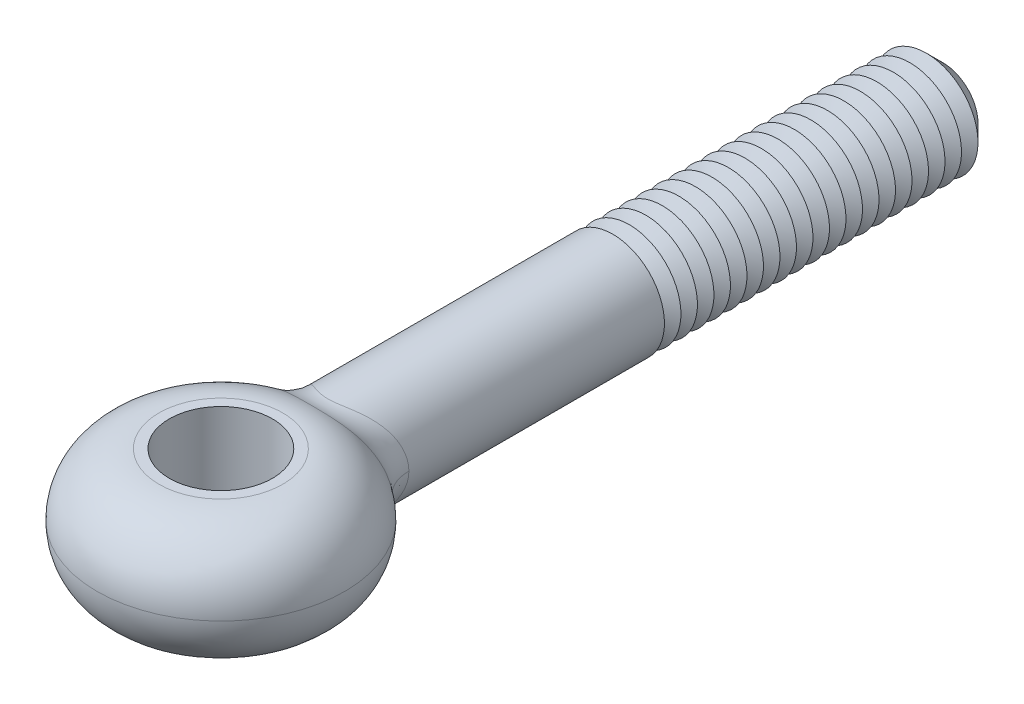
ISO-10303-21;
HEADER;
FILE_DESCRIPTION(('STEP AP214'),'2;1');
FILE_NAME('part.step','',(''),(''),'','','');
FILE_SCHEMA(('AUTOMOTIVE_DESIGN { 1 0 10303 214 1 1 1 1 }'));
ENDSEC;
DATA;
#1=APPLICATION_CONTEXT('core data for automotive mechanical design processes');
#2=APPLICATION_PROTOCOL_DEFINITION('international standard','automotive_design',2000,#1);
#3=PRODUCT_CONTEXT('',#1,'mechanical');
#4=PRODUCT('Part','Part','',(#3));
#5=PRODUCT_RELATED_PRODUCT_CATEGORY('part','',(#4));
#6=PRODUCT_DEFINITION_FORMATION('','',#4);
#7=PRODUCT_DEFINITION_CONTEXT('part definition',#1,'design');
#8=PRODUCT_DEFINITION('design','',#6,#7);
#9=PRODUCT_DEFINITION_SHAPE('','',#8);
#10=(LENGTH_UNIT() NAMED_UNIT(*) SI_UNIT(.MILLI.,.METRE.));
#11=(NAMED_UNIT(*) PLANE_ANGLE_UNIT() SI_UNIT($,.RADIAN.));
#12=(NAMED_UNIT(*) SI_UNIT($,.STERADIAN.) SOLID_ANGLE_UNIT());
#13=UNCERTAINTY_MEASURE_WITH_UNIT(LENGTH_MEASURE(1.E-05),#10,'distance_accuracy_value','');
#14=(GEOMETRIC_REPRESENTATION_CONTEXT(3) GLOBAL_UNCERTAINTY_ASSIGNED_CONTEXT((#13)) GLOBAL_UNIT_ASSIGNED_CONTEXT((#10,
#11,#12)) REPRESENTATION_CONTEXT('',''));
#15=CARTESIAN_POINT('',(0.,0.,0.));
#16=DIRECTION('',(0.,0.,1.));
#17=DIRECTION('',(1.,0.,0.));
#18=AXIS2_PLACEMENT_3D('',#15,#16,#17);
#19=CARTESIAN_POINT('',(0.,0.,-35.));
#20=DIRECTION('',(0.,0.,1.));
#21=DIRECTION('',(1.,0.,0.));
#22=AXIS2_PLACEMENT_3D('',#19,#20,#21);
#23=CYLINDRICAL_SURFACE('',#22,2.5);
#24=CARTESIAN_POINT('',(0.,0.,-19.));
#25=DIRECTION('',(0.,0.,-1.));
#26=DIRECTION('',(-1.,0.,0.));
#27=AXIS2_PLACEMENT_3D('',#24,#25,#26);
#28=CIRCLE('',#27,2.5);
#29=CARTESIAN_POINT('',(-2.5,0.,-19.));
#30=VERTEX_POINT('',#29);
#31=EDGE_CURVE('E79',#30,#30,#28,.T.);
#32=ORIENTED_EDGE('',*,*,#31,.F.);
#33=EDGE_LOOP('',(#32));
#34=FACE_BOUND('',#33,.T.);
#35=CARTESIAN_POINT('',(2.78341953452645,-1.59186120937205,-4.79327924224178));
#36=CARTESIAN_POINT('',(2.14571805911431,-1.30072530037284,-5.3743447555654));
#37=CARTESIAN_POINT('',(2.01927820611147,-1.47394556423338,-6.25925612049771));
#38=CARTESIAN_POINT('',(2.831703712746,-1.53469920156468,-4.80662089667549));
#39=CARTESIAN_POINT('',(2.1772769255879,-1.24792172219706,-5.3898625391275));
#40=CARTESIAN_POINT('',(2.05791099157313,-1.42101777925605,-6.2878456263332));
#41=CARTESIAN_POINT('',(2.87731821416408,-1.47574824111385,-4.81931887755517));
#42=CARTESIAN_POINT('',(2.20644442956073,-1.19462176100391,-5.40436026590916));
#43=CARTESIAN_POINT('',(2.09456285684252,-1.36643355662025,-6.31497994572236));
#44=CARTESIAN_POINT('',(2.96300366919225,-1.35453728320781,-4.8433013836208));
#45=CARTESIAN_POINT('',(2.26036740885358,-1.08700563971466,-5.43139492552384));
#46=CARTESIAN_POINT('',(2.16363788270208,-1.25420118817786,-6.36611531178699));
#47=CARTESIAN_POINT('',(3.00307308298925,-1.29227637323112,-4.85458551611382));
#48=CARTESIAN_POINT('',(2.28509247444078,-1.0327073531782,-5.44391770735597));
#49=CARTESIAN_POINT('',(2.19605986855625,-1.19655219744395,-6.39011548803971));
#50=CARTESIAN_POINT('',(3.11457798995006,-1.10105207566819,-4.88610560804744));
#51=CARTESIAN_POINT('',(2.35298983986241,-0.868493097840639,-5.47855834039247));
#52=CARTESIAN_POINT('',(2.28651645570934,-1.0194926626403,-6.45703286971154));
#53=CARTESIAN_POINT('',(3.17736416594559,-0.967583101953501,-4.90402434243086));
#54=CARTESIAN_POINT('',(2.38951585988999,-0.757939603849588,-5.49756398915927));
#55=CARTESIAN_POINT('',(2.33778513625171,-0.895910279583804,-6.49489913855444));
#56=CARTESIAN_POINT('',(3.2762931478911,-0.696845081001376,-4.93234966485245));
#57=CARTESIAN_POINT('',(2.44601304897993,-0.539370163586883,-5.52722187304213));
#58=CARTESIAN_POINT('',(2.41878010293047,-0.64522692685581,-6.55463771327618));
#59=CARTESIAN_POINT('',(3.31322228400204,-0.559833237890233,-4.94297774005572));
#60=CARTESIAN_POINT('',(2.46634024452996,-0.431613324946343,-5.53805203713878));
#61=CARTESIAN_POINT('',(2.44914166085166,-0.518364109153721,-6.57698187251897));
#62=CARTESIAN_POINT('',(3.36256644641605,-0.281879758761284,-4.95719210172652));
#63=CARTESIAN_POINT('',(2.49336316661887,-0.215769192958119,-5.55249569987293));
#64=CARTESIAN_POINT('',(2.48974403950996,-0.260999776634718,-6.60684652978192));
#65=CARTESIAN_POINT('',(3.37499961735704,-0.140941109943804,-4.96078360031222));
#66=CARTESIAN_POINT('',(2.49999900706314,-0.107956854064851,-5.55607731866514));
#67=CARTESIAN_POINT('',(2.49999975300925,-0.130501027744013,-6.61437799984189));
#68=CARTESIAN_POINT('',(3.37500038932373,0.143401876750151,-4.96078381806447));
#69=CARTESIAN_POINT('',(2.50000101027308,0.109841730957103,-5.55607819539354));
#70=CARTESIAN_POINT('',(2.50000025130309,0.132779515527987,-6.61437856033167));
#71=CARTESIAN_POINT('',(3.36213005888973,0.286806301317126,-4.9570660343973));
#72=CARTESIAN_POINT('',(2.49313362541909,0.21953405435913,-5.55237139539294));
#73=CARTESIAN_POINT('',(2.48938379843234,0.265561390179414,-6.60658237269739));
#74=CARTESIAN_POINT('',(3.31105376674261,0.569447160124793,-4.94235345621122));
#75=CARTESIAN_POINT('',(2.4651455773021,0.439127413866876,-5.53741516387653));
#76=CARTESIAN_POINT('',(2.44735853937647,0.527265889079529,-6.57566949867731));
#77=CARTESIAN_POINT('',(3.2728375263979,0.708681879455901,-4.93135570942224));
#78=CARTESIAN_POINT('',(2.44409422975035,0.548739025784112,-5.52620260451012));
#79=CARTESIAN_POINT('',(2.41594129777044,0.656186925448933,-6.55254659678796));
#80=CARTESIAN_POINT('',(3.17230532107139,0.978796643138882,-4.90258103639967));
#81=CARTESIAN_POINT('',(2.3865722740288,0.767190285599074,-5.4960319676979));
#82=CARTESIAN_POINT('',(2.33365404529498,0.906293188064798,-6.49184951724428));
#83=CARTESIAN_POINT('',(3.11002745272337,1.10968951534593,-4.88481482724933));
#84=CARTESIAN_POINT('',(2.35027184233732,0.875780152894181,-5.47716086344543));
#85=CARTESIAN_POINT('',(2.28281478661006,1.02749029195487,-6.45429818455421));
#86=CARTESIAN_POINT('',(2.96306047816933,1.36001779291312,-4.84327946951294));
#87=CARTESIAN_POINT('',(2.26083780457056,1.09062442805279,-5.43155444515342));
#88=CARTESIAN_POINT('',(2.163610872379,1.25927573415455,-6.36610676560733));
#89=CARTESIAN_POINT('',(2.87837355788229,1.47945431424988,-4.81951090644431));
#90=CARTESIAN_POINT('',(2.20790880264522,1.19669657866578,-5.40491826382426));
#91=CARTESIAN_POINT('',(2.0952479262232,1.36986510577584,-6.31546795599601));
#92=CARTESIAN_POINT('',(2.68558517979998,1.7076778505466,-4.76625186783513));
#93=CARTESIAN_POINT('',(2.08220250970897,1.40697007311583,-5.34311996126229));
#94=CARTESIAN_POINT('',(1.94100402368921,1.58118319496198,-6.20133915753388));
#95=CARTESIAN_POINT('',(2.57685139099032,1.8160319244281,-4.73660969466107));
#96=CARTESIAN_POINT('',(2.00910730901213,1.51094837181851,-5.30782806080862));
#97=CARTESIAN_POINT('',(1.85465458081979,1.68151104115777,-6.13750593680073));
#98=CARTESIAN_POINT('',(2.33928032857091,2.01584554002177,-4.67361867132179));
#99=CARTESIAN_POINT('',(1.84304754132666,1.71007551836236,-5.23013197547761));
#100=CARTESIAN_POINT('',(1.66833418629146,1.86652364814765,-6.00086530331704));
#101=CARTESIAN_POINT('',(2.21043096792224,2.10729485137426,-4.64026759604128));
#102=CARTESIAN_POINT('',(1.75031966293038,1.8052391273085,-5.18781856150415));
#103=CARTESIAN_POINT('',(1.56835504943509,1.95119893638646,-5.92805250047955));
#104=CARTESIAN_POINT('',(1.99751216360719,2.23394098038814,-4.58780602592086));
#105=CARTESIAN_POINT('',(1.59194994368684,1.94203878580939,-5.11897301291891));
#106=CARTESIAN_POINT('',(1.4058468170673,2.06846387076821,-5.81257645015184));
#107=CARTESIAN_POINT('',(1.92009823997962,2.2756671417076,-4.56919966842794));
#108=CARTESIAN_POINT('',(1.5336987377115,1.98802800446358,-5.09422592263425));
#109=CARTESIAN_POINT('',(1.34723871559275,2.10709920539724,-5.77144648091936));
#110=CARTESIAN_POINT('',(1.75973784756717,2.35363226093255,-4.53203912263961));
#111=CARTESIAN_POINT('',(1.41145270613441,2.0755845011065,-5.04404873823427));
#112=CARTESIAN_POINT('',(1.22703303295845,2.17928913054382,-5.68893121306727));
#113=CARTESIAN_POINT('',(1.6767929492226,2.38987276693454,-4.51348492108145));
#114=CARTESIAN_POINT('',(1.3474791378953,2.11718338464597,-5.01861818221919));
#115=CARTESIAN_POINT('',(1.16543630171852,2.21284515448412,-5.6475459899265));
#116=CARTESIAN_POINT('',(1.5051830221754,2.45675134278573,-4.47701205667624));
#117=CARTESIAN_POINT('',(1.21372799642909,2.19531106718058,-4.96793801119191));
#118=CARTESIAN_POINT('',(1.03940209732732,2.27476976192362,-5.5658219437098));
#119=CARTESIAN_POINT('',(1.41651302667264,2.48738445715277,-4.45909396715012));
#120=CARTESIAN_POINT('',(1.14395137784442,2.23187357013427,-4.94267911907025));
#121=CARTESIAN_POINT('',(0.974962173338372,2.30313375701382,-5.52548407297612));
#122=CARTESIAN_POINT('',(1.2334267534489,2.54282715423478,-4.4247261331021));
#123=CARTESIAN_POINT('',(0.998757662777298,2.29910433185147,-4.89365860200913));
#124=CARTESIAN_POINT('',(0.843479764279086,2.35446958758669,-5.44777655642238));
#125=CARTESIAN_POINT('',(1.13901258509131,2.56763885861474,-4.40827585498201));
#126=CARTESIAN_POINT('',(0.923330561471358,2.32981830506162,-4.86987717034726));
#127=CARTESIAN_POINT('',(0.77643823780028,2.37744338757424,-5.41040583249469));
#128=CARTESIAN_POINT('',(0.906301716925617,2.6196969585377,-4.37198138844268));
#129=CARTESIAN_POINT('',(0.736578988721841,2.39507218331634,-4.81694956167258));
#130=CARTESIAN_POINT('',(0.613199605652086,2.42564533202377,-5.32763271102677));
#131=CARTESIAN_POINT('',(0.765194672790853,2.6441512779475,-4.35329767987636));
#132=CARTESIAN_POINT('',(0.622406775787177,2.42664265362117,-4.78918338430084));
#133=CARTESIAN_POINT('',(0.515784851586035,2.44828822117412,-5.28474181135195));
#134=CARTESIAN_POINT('',(0.546606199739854,2.67131287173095,-4.33168473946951));
#135=CARTESIAN_POINT('',(0.444918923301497,2.46206701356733,-4.756847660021));
#136=CARTESIAN_POINT('',(0.366917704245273,2.47343784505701,-5.23496757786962));
#137=CARTESIAN_POINT('',(0.472728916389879,2.67877512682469,-4.3255545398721));
#138=CARTESIAN_POINT('',(0.384868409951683,2.47188464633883,-4.74762646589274));
#139=CARTESIAN_POINT('',(0.316930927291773,2.4803473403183,-5.22081573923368));
#140=CARTESIAN_POINT('',(0.323225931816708,2.69043587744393,-4.31584469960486));
#141=CARTESIAN_POINT('',(0.263268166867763,2.48727604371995,-4.7329952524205));
#142=CARTESIAN_POINT('',(0.21623936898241,2.49114433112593,-5.19837742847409));
#143=CARTESIAN_POINT('',(0.24760125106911,2.69463623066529,-4.31226360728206));
#144=CARTESIAN_POINT('',(0.201683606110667,2.49286186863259,-4.72757415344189));
#145=CARTESIAN_POINT('',(0.165535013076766,2.49503354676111,-5.19008761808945));
#146=CARTESIAN_POINT('',(0.094861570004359,2.69970310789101,-4.30793149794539));
#147=CARTESIAN_POINT('',(0.0772955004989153,2.49960079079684,-4.72101731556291));
#148=CARTESIAN_POINT('',(0.0633454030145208,2.49972510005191,-5.18005710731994));
#149=CARTESIAN_POINT('',(0.017739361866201,2.70054092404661,-4.30720485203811));
#150=CARTESIAN_POINT('',(0.0144434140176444,2.50072036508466,-4.71991397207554));
#151=CARTESIAN_POINT('',(0.0118571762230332,2.500500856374,-5.17837280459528));
#152=CARTESIAN_POINT('',(-0.136203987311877,2.69878264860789,-4.30871632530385));
#153=CARTESIAN_POINT('',(-0.110955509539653,2.49837825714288,-4.72220376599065));
#154=CARTESIAN_POINT('',(-0.0909950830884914,2.49887282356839,-5.18187386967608));
#155=CARTESIAN_POINT('',(-0.213025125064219,2.69618651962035,-4.31095447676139));
#156=CARTESIAN_POINT('',(-0.173546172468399,2.49491488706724,-4.72559855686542));
#157=CARTESIAN_POINT('',(-0.142359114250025,2.49646899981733,-5.18705931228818));
#158=CARTESIAN_POINT('',(-0.36553597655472,2.68761038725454,-4.31820554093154));
#159=CARTESIAN_POINT('',(-0.297684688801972,2.48354513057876,-4.73655288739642));
#160=CARTESIAN_POINT('',(-0.244685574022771,2.48852813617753,-5.20383450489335));
#161=CARTESIAN_POINT('',(-0.441220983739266,2.6816189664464,-4.32322781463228));
#162=CARTESIAN_POINT('',(-0.359268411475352,2.47561613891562,-4.74413371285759));
#163=CARTESIAN_POINT('',(-0.295646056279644,2.48298052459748,-5.21544586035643));
#164=CARTESIAN_POINT('',(-0.590415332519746,2.6663656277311,-4.33565461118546));
#165=CARTESIAN_POINT('',(-0.480475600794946,2.4556075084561,-4.76278791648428));
#166=CARTESIAN_POINT('',(-0.396672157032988,2.46885706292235,-5.24411576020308));
#167=CARTESIAN_POINT('',(-0.663923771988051,2.65710237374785,-4.34306010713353));
#168=CARTESIAN_POINT('',(-0.540131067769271,2.44351406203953,-4.77387344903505));
#169=CARTESIAN_POINT('',(-0.44673740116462,2.46027997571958,-5.26117652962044));
#170=CARTESIAN_POINT('',(-0.831352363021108,2.63198098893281,-4.36244332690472));
#171=CARTESIAN_POINT('',(-0.675735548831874,2.41105829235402,-4.80270108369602));
#172=CARTESIAN_POINT('',(-0.561587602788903,2.43701943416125,-5.30571455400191));
#173=CARTESIAN_POINT('',(-0.924289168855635,2.6149613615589,-4.37512591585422));
#174=CARTESIAN_POINT('',(-0.750790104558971,2.38927243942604,-4.82144973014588));
#175=CARTESIAN_POINT('',(-0.625964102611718,2.42126052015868,-5.33477828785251));
#176=CARTESIAN_POINT('',(-1.10516352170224,2.57574008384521,-4.40274397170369));
#177=CARTESIAN_POINT('',(-0.89617727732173,2.33992937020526,-4.86182815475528));
#178=CARTESIAN_POINT('',(-0.752583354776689,2.38494452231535,-5.39780912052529));
#179=CARTESIAN_POINT('',(-1.19309918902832,2.55353650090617,-4.41768027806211));
#180=CARTESIAN_POINT('',(-0.966539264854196,2.31233373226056,-4.88348226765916));
#181=CARTESIAN_POINT('',(-0.814825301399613,2.36438564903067,-5.43177804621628));
#182=CARTESIAN_POINT('',(-1.36408592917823,2.50411967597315,-4.44895154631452));
#183=CARTESIAN_POINT('',(-1.10247087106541,2.25205127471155,-4.92826951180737));
#184=CARTESIAN_POINT('',(-0.937136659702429,2.31862932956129,-5.50258991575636));
#185=CARTESIAN_POINT('',(-1.4471314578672,2.47690088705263,-4.46528804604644));
#186=CARTESIAN_POINT('',(-1.16804717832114,2.21932398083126,-4.95142074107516));
#187=CARTESIAN_POINT('',(-0.997203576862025,2.29342674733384,-5.53943601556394));
#188=CARTESIAN_POINT('',(-1.60835015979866,2.41761835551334,-4.49866880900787));
#189=CARTESIAN_POINT('',(-1.29428986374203,2.14941948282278,-4.99811371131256));
#190=CARTESIAN_POINT('',(-1.11497966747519,2.23853551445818,-5.61439808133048));
#191=CARTESIAN_POINT('',(-1.68652398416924,2.38555526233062,-4.51571297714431));
#192=CARTESIAN_POINT('',(-1.3549551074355,2.11221158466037,-5.02166467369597));
#193=CARTESIAN_POINT('',(-1.17268915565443,2.20884746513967,-5.65251387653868));
#194=CARTESIAN_POINT('',(-1.84102679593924,2.31537342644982,-4.55065121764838));
#195=CARTESIAN_POINT('',(-1.47363936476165,2.03237790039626,-5.06928809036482));
#196=CARTESIAN_POINT('',(-1.28777958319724,2.1438642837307,-5.73031643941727));
#197=CARTESIAN_POINT('',(-1.91717041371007,2.27706976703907,-4.56855283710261));
#198=CARTESIAN_POINT('',(-1.5314431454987,1.98957796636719,-5.09334433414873));
#199=CARTESIAN_POINT('',(-1.34506326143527,2.10839793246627,-5.77000745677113));
#200=CARTESIAN_POINT('',(-2.06435914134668,2.19549414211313,-4.60411592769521));
#201=CARTESIAN_POINT('',(-1.64179513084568,1.90033354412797,-5.14043913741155));
#202=CARTESIAN_POINT('',(-1.45671149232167,2.03286494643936,-5.84853073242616));
#203=CARTESIAN_POINT('',(-2.13540269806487,2.15222067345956,-4.62177732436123));
#204=CARTESIAN_POINT('',(-1.69431856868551,1.85386594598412,-5.16347382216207));
#205=CARTESIAN_POINT('',(-1.51107515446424,1.99279691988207,-5.88736272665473));
#206=CARTESIAN_POINT('',(-2.34062893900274,2.01525525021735,-4.67380595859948));
#207=CARTESIAN_POINT('',(-1.84426716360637,1.70956328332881,-5.23047721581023));
#208=CARTESIAN_POINT('',(-1.66923732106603,1.86597708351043,-6.00131438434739));
#209=CARTESIAN_POINT('',(-2.46717911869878,1.91429396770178,-4.70728175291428));
#210=CARTESIAN_POINT('',(-1.93332878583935,1.60734351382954,-5.27203498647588));
#211=CARTESIAN_POINT('',(-1.76831121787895,1.7724944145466,-6.07403221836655));
#212=CARTESIAN_POINT('',(-2.70679041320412,1.68661240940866,-4.77193962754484));
#213=CARTESIAN_POINT('',(-2.09686028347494,1.38674049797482,-5.35007469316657));
#214=CARTESIAN_POINT('',(-1.95773190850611,1.56167815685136,-6.21363092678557));
#215=CARTESIAN_POINT('',(-2.81813452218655,1.55853025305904,-4.80276284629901));
#216=CARTESIAN_POINT('',(-2.16933176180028,1.26784061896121,-5.38577211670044));
#217=CARTESIAN_POINT('',(-2.04687161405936,1.44308356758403,-6.27966835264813));
#218=CARTESIAN_POINT('',(-3.01261219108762,1.28525500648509,-4.85717783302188));
#219=CARTESIAN_POINT('',(-2.29190513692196,1.02488048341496,-5.44718873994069));
#220=CARTESIAN_POINT('',(-2.20361102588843,1.19005093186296,-6.39571302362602));
#221=CARTESIAN_POINT('',(-3.09572994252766,1.14005238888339,-4.8807655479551));
#222=CARTESIAN_POINT('',(-2.34165620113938,0.901027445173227,-5.47274428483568));
#223=CARTESIAN_POINT('',(-2.27119866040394,1.05560406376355,-6.44571128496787));
#224=CARTESIAN_POINT('',(-3.22543031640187,0.849553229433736,-4.91775305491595));
#225=CARTESIAN_POINT('',(-2.41740189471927,0.661472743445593,-5.51211129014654));
#226=CARTESIAN_POINT('',(-2.37706331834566,0.786623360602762,-6.5238938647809));
#227=CARTESIAN_POINT('',(-3.27441877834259,0.705208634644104,-4.93182105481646));
#228=CARTESIAN_POINT('',(-2.44479989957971,0.546140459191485,-5.52660885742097));
#229=CARTESIAN_POINT('',(-2.41726455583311,0.652970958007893,-6.55351221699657));
#230=CARTESIAN_POINT('',(-3.3444386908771,0.410725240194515,-4.95196114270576));
#231=CARTESIAN_POINT('',(-2.48358904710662,0.315091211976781,-5.54724099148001));
#232=CARTESIAN_POINT('',(-2.47480549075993,0.380301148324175,-6.59586878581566));
#233=CARTESIAN_POINT('',(-3.365557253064,0.260606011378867,-4.95805814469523));
#234=CARTESIAN_POINT('',(-2.49491680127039,0.199701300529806,-5.55334192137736));
#235=CARTESIAN_POINT('',(-2.49221642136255,0.241301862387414,-6.6086595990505));
#236=CARTESIAN_POINT('',(-3.3741611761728,0.0734663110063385,-4.96054177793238));
#237=CARTESIAN_POINT('',(-2.49954473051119,0.0562665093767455,-5.55583336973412));
#238=CARTESIAN_POINT('',(-2.49930902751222,0.06802436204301,-6.61387040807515));
#239=CARTESIAN_POINT('',(-3.37500321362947,0.0367413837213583,-4.9607847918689));
#240=CARTESIAN_POINT('',(-2.49999869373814,0.0281412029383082,-5.55607760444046));
#241=CARTESIAN_POINT('',(-2.50000304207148,0.0340197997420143,-6.61438032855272));
#242=CARTESIAN_POINT('',(-3.37498749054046,-0.143020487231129,-4.9607794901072));
#243=CARTESIAN_POINT('',(-2.50000508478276,-0.109543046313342,-5.55607833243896));
#244=CARTESIAN_POINT('',(-2.49998815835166,-0.132426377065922,-6.61437029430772));
#245=CARTESIAN_POINT('',(-3.36216727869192,-0.286290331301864,-4.9570765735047));
#246=CARTESIAN_POINT('',(-2.49315564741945,-0.219138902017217,-5.55238275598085));
#247=CARTESIAN_POINT('',(-2.48941413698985,-0.265083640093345,-6.60660464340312));
#248=CARTESIAN_POINT('',(-3.31118832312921,-0.5690125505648,-4.94239239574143));
#249=CARTESIAN_POINT('',(-2.46521750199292,-0.438784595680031,-5.53745400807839));
#250=CARTESIAN_POINT('',(-2.44746953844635,-0.526863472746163,-6.57575118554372));
#251=CARTESIAN_POINT('',(-3.2729343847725,-0.708448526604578,-4.93138379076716));
#252=CARTESIAN_POINT('',(-2.44415038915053,-0.548545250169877,-5.5262324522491));
#253=CARTESIAN_POINT('',(-2.41602083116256,-0.65597085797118,-6.55260581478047));
#254=CARTESIAN_POINT('',(-3.172210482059,-0.979024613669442,-4.90255353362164));
#255=CARTESIAN_POINT('',(-2.38651784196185,-0.767377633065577,-5.49600302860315));
#256=CARTESIAN_POINT('',(-2.3335761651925,-0.906504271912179,-6.49179151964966));
#257=CARTESIAN_POINT('',(-3.10977969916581,-1.11017775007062,-4.88474290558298));
#258=CARTESIAN_POINT('',(-2.35012430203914,-0.876197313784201,-5.47708301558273));
#259=CARTESIAN_POINT('',(-2.28261183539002,-1.0279423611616,-6.45414609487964));
#260=CARTESIAN_POINT('',(-2.99946679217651,-1.29797370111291,-4.85356946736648));
#261=CARTESIAN_POINT('',(-2.28287045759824,-1.0376648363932,-5.44279118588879));
#262=CARTESIAN_POINT('',(-2.19314078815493,-1.2018275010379,-6.3879550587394));
#263=CARTESIAN_POINT('',(-2.95997615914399,-1.35901454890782,-4.84245162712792));
#264=CARTESIAN_POINT('',(-2.25847709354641,-1.0909506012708,-5.43044281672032));
#265=CARTESIAN_POINT('',(-2.16119309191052,-1.25834680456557,-6.36430554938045));
#266=CARTESIAN_POINT('',(-2.87565347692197,-1.4778979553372,-4.81885538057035));
#267=CARTESIAN_POINT('',(-2.20537734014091,-1.19657026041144,-5.40382980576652));
#268=CARTESIAN_POINT('',(-2.09322519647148,-1.36842403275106,-6.31398947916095));
#269=CARTESIAN_POINT('',(-2.83082295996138,-1.53574142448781,-4.8063773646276));
#270=CARTESIAN_POINT('',(-2.17669982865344,-1.24888735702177,-5.38957859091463));
#271=CARTESIAN_POINT('',(-2.05720616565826,-1.42198280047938,-6.2873237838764));
#272=CARTESIAN_POINT('',(-2.78341953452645,-1.59186120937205,-4.79327924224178));
#273=CARTESIAN_POINT('',(-2.14571805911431,-1.30072530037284,-5.3743447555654));
#274=CARTESIAN_POINT('',(-2.01927820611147,-1.47394556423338,-6.25925612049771));
#275=(BOUNDED_SURFACE() B_SPLINE_SURFACE(3,2,((#35,#36,#37),(#38,#39,#40),(#41,#42,#43),(#44,
#45,#46),(#47,#48,#49),(#50,#51,#52),(#53,#54,#55),(#56,#57,#58),(#59,#60,#61),(#62,#63,#64),
(#65,#66,#67),(#68,#69,#70),(#71,#72,#73),(#74,#75,#76),(#77,#78,#79),(#80,#81,#82),(#83,#84,
#85),(#86,#87,#88),(#89,#90,#91),(#92,#93,#94),(#95,#96,#97),(#98,#99,#100),(#101,#102,#103),
(#104,#105,#106),(#107,#108,#109),(#110,#111,#112),(#113,#114,#115),(#116,#117,#118),(#119,#120,
#121),(#122,#123,#124),(#125,#126,#127),(#128,#129,#130),(#131,#132,#133),(#134,#135,#136),
(#137,#138,#139),(#140,#141,#142),(#143,#144,#145),(#146,#147,#148),(#149,#150,#151),(#152,#153,
#154),(#155,#156,#157),(#158,#159,#160),(#161,#162,#163),(#164,#165,#166),(#167,#168,#169),
(#170,#171,#172),(#173,#174,#175),(#176,#177,#178),(#179,#180,#181),(#182,#183,#184),(#185,#186,
#187),(#188,#189,#190),(#191,#192,#193),(#194,#195,#196),(#197,#198,#199),(#200,#201,#202),
(#203,#204,#205),(#206,#207,#208),(#209,#210,#211),(#212,#213,#214),(#215,#216,#217),(#218,#219,
#220),(#221,#222,#223),(#224,#225,#226),(#227,#228,#229),(#230,#231,#232),(#233,#234,#235),
(#236,#237,#238),(#239,#240,#241),(#242,#243,#244),(#245,#246,#247),(#248,#249,#250),(#251,#252,
#253),(#254,#255,#256),(#257,#258,#259),(#260,#261,#262),(#263,#264,#265),(#266,#267,#268),
(#269,#270,#271),(#272,#273,#274)),.UNSPECIFIED.,.F.,.F.,.F.) B_SPLINE_SURFACE_WITH_KNOTS((4,2,
2,2,2,2,2,2,2,2,2,2,2,2,2,2,2,2,2,2,2,2,2,2,2,2,2,2,2,2,2,2,2,2,2,2,2,2,2,4),(3,3),(0.,
0.363898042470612,0.727896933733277,1.45549120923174,2.15986563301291,2.86371811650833,
3.57985953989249,4.2962915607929,5.01159387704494,5.72682644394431,6.46375484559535,
7.20112776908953,7.5994115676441,7.99758275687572,8.39610414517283,8.79448006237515,
9.34746095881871,9.62295413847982,9.89829030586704,10.175972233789,10.4536571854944,
10.7322815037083,11.0110197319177,11.3788266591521,11.7467709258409,12.1151246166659,
12.4834289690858,12.8658412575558,13.2483695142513,14.0121043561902,14.8329658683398,
15.6542863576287,16.4093703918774,17.1620886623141,17.3457541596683,18.060695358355,
18.7783276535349,19.4948017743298,19.8521704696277,20.2094368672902),(0.,1.),
.UNSPECIFIED.) GEOMETRIC_REPRESENTATION_ITEM() RATIONAL_B_SPLINE_SURFACE(((1.,0.91012003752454,
1.),(1.,0.908112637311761,1.),(1.,0.906182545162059,1.),(1.,0.902507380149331,1.),(1.,
0.900762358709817,1.),(1.,0.895853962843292,1.),(1.,0.8930149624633,1.),(1.,0.888491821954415,
1.),(1.,0.886773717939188,1.),(1.,0.884469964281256,1.),(1.,0.883883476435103,1.),(1.,
0.883883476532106,1.),(1.,0.884490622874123,1.),(1.,0.886874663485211,1.),(1.,0.888652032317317,
1.),(1.,0.893243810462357,1.),(1.,0.896056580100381,1.),(1.,0.902521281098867,1.),(1.,
0.906173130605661,1.),(1.,0.914186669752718,1.),(1.,0.918566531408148,1.),(1.,0.927642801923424,
1.),(1.,0.932339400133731,1.),(1.,0.939527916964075,1.),(1.,0.942040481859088,1.),(1.,
0.946983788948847,1.),(1.,0.949414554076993,1.),(1.,0.954120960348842,1.),(1.,0.95639646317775,
1.),(1.,0.960697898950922,1.),(1.,0.962723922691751,1.),(1.,0.967135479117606,1.),(1.,
0.969355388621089,1.),(1.,0.971895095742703,1.),(1.,0.972609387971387,1.),(1.,0.973736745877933,
1.),(1.,0.974149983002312,1.),(1.,0.974649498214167,1.),(1.,0.974732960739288,1.),(1.,
0.974558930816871,1.),(1.,0.974301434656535,1.),(1.,0.973462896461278,1.),(1.,0.972880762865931,
1.),(1.,0.971429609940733,1.),(1.,0.970560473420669,1.),(1.,0.968264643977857,1.),(1.,
0.966748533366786,1.),(1.,0.963399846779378,1.),(1.,0.961567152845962,1.),(1.,0.957673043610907,
1.),(1.,0.955611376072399,1.),(1.,0.951336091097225,1.),(1.,0.949122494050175,1.),(1.,
0.944519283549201,1.),(1.,0.942126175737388,1.),(1.,0.937304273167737,1.),(1.,0.934875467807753,
1.),(1.,0.92762365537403,1.),(1.,0.922826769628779,1.),(1.,0.913355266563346,1.),(1.,
0.908716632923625,1.),(1.,0.900383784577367,1.),(1.,0.896690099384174,1.),(1.,0.890834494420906,
1.),(1.,0.888573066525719,1.),(1.,0.885321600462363,1.),(1.,0.88432760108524,1.),(1.,
0.883922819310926,1.),(1.,0.883883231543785,1.),(1.,0.883884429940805,1.),(1.,0.884488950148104,
1.),(1.,0.886868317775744,1.),(1.,0.88864756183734,1.),(1.,0.893248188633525,1.),(1.,
0.896067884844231,1.),(1.,0.900919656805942,1.),(1.,0.902638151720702,1.),(1.,0.906252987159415,
1.),(1.,0.908149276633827,1.),(1.,0.91012003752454,1.))) REPRESENTATION_ITEM('') SURFACE());
#276=CARTESIAN_POINT('',(-2.01927820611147,-1.47394556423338,-6.25925612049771));
#277=CARTESIAN_POINT('',(-2.05720616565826,-1.42198280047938,-6.2873237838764));
#278=CARTESIAN_POINT('',(-2.09322519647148,-1.36842403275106,-6.31398947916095));
#279=CARTESIAN_POINT('',(-2.16119309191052,-1.25834680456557,-6.36430554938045));
#280=CARTESIAN_POINT('',(-2.19314078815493,-1.2018275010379,-6.3879550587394));
#281=CARTESIAN_POINT('',(-2.28261183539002,-1.0279423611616,-6.45414609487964));
#282=CARTESIAN_POINT('',(-2.3335761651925,-0.906504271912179,-6.49179151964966));
#283=CARTESIAN_POINT('',(-2.41602083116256,-0.655970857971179,-6.55260581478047));
#284=CARTESIAN_POINT('',(-2.44746953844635,-0.526863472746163,-6.57575118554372));
#285=CARTESIAN_POINT('',(-2.48941413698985,-0.265083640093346,-6.60660464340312));
#286=CARTESIAN_POINT('',(-2.49998815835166,-0.132426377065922,-6.61437029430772));
#287=CARTESIAN_POINT('',(-2.50000304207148,0.0340197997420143,-6.61438032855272));
#288=CARTESIAN_POINT('',(-2.49930902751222,0.0680243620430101,-6.61387040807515));
#289=CARTESIAN_POINT('',(-2.49221642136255,0.241301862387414,-6.6086595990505));
#290=CARTESIAN_POINT('',(-2.47480549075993,0.380301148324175,-6.59586878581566));
#291=CARTESIAN_POINT('',(-2.41726455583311,0.652970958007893,-6.55351221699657));
#292=CARTESIAN_POINT('',(-2.37706331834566,0.786623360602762,-6.5238938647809));
#293=CARTESIAN_POINT('',(-2.27119866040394,1.05560406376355,-6.44571128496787));
#294=CARTESIAN_POINT('',(-2.20361102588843,1.19005093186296,-6.39571302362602));
#295=CARTESIAN_POINT('',(-2.04687161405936,1.44308356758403,-6.27966835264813));
#296=CARTESIAN_POINT('',(-1.95773190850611,1.56167815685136,-6.21363092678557));
#297=CARTESIAN_POINT('',(-1.76831121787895,1.7724944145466,-6.07403221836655));
#298=CARTESIAN_POINT('',(-1.66923732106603,1.86597708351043,-6.00131438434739));
#299=CARTESIAN_POINT('',(-1.51107515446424,1.99279691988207,-5.88736272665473));
#300=CARTESIAN_POINT('',(-1.45671149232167,2.03286494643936,-5.84853073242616));
#301=CARTESIAN_POINT('',(-1.34506326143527,2.10839793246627,-5.77000745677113));
#302=CARTESIAN_POINT('',(-1.28777958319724,2.1438642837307,-5.73031643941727));
#303=CARTESIAN_POINT('',(-1.17268915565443,2.20884746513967,-5.65251387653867));
#304=CARTESIAN_POINT('',(-1.11497966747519,2.23853551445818,-5.61439808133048));
#305=CARTESIAN_POINT('',(-0.997203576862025,2.29342674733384,-5.53943601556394));
#306=CARTESIAN_POINT('',(-0.937136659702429,2.31862932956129,-5.50258991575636));
#307=CARTESIAN_POINT('',(-0.814825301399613,2.36438564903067,-5.43177804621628));
#308=CARTESIAN_POINT('',(-0.752583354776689,2.38494452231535,-5.39780912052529));
#309=CARTESIAN_POINT('',(-0.625964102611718,2.42126052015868,-5.33477828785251));
#310=CARTESIAN_POINT('',(-0.561587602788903,2.43701943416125,-5.30571455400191));
#311=CARTESIAN_POINT('',(-0.44673740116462,2.46027997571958,-5.26117652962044));
#312=CARTESIAN_POINT('',(-0.396672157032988,2.46885706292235,-5.24411576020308));
#313=CARTESIAN_POINT('',(-0.295646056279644,2.48298052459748,-5.21544586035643));
#314=CARTESIAN_POINT('',(-0.244685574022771,2.48852813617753,-5.20383450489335));
#315=CARTESIAN_POINT('',(-0.142359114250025,2.49646899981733,-5.18705931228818));
#316=CARTESIAN_POINT('',(-0.0909950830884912,2.49887282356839,-5.18187386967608));
#317=CARTESIAN_POINT('',(0.0118571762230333,2.500500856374,-5.17837280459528));
#318=CARTESIAN_POINT('',(0.0633454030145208,2.49972510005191,-5.18005710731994));
#319=CARTESIAN_POINT('',(0.165535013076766,2.49503354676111,-5.19008761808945));
#320=CARTESIAN_POINT('',(0.21623936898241,2.49114433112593,-5.19837742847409));
#321=CARTESIAN_POINT('',(0.316930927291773,2.4803473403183,-5.22081573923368));
#322=CARTESIAN_POINT('',(0.366917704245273,2.47343784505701,-5.23496757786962));
#323=CARTESIAN_POINT('',(0.515784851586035,2.44828822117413,-5.28474181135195));
#324=CARTESIAN_POINT('',(0.613199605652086,2.42564533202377,-5.32763271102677));
#325=CARTESIAN_POINT('',(0.77643823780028,2.37744338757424,-5.41040583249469));
#326=CARTESIAN_POINT('',(0.843479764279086,2.35446958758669,-5.44777655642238));
#327=CARTESIAN_POINT('',(0.974962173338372,2.30313375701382,-5.52548407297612));
#328=CARTESIAN_POINT('',(1.03940209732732,2.27476976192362,-5.5658219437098));
#329=CARTESIAN_POINT('',(1.16543630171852,2.21284515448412,-5.6475459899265));
#330=CARTESIAN_POINT('',(1.22703303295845,2.17928913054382,-5.68893121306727));
#331=CARTESIAN_POINT('',(1.34723871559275,2.10709920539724,-5.77144648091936));
#332=CARTESIAN_POINT('',(1.4058468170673,2.06846387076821,-5.81257645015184));
#333=CARTESIAN_POINT('',(1.56835504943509,1.95119893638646,-5.92805250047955));
#334=CARTESIAN_POINT('',(1.66833418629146,1.86652364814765,-6.00086530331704));
#335=CARTESIAN_POINT('',(1.85465458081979,1.68151104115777,-6.13750593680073));
#336=CARTESIAN_POINT('',(1.94100402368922,1.58118319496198,-6.20133915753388));
#337=CARTESIAN_POINT('',(2.0952479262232,1.36986510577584,-6.31546795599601));
#338=CARTESIAN_POINT('',(2.163610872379,1.25927573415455,-6.36610676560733));
#339=CARTESIAN_POINT('',(2.28281478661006,1.02749029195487,-6.45429818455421));
#340=CARTESIAN_POINT('',(2.33365404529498,0.906293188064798,-6.49184951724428));
#341=CARTESIAN_POINT('',(2.41594129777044,0.656186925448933,-6.55254659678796));
#342=CARTESIAN_POINT('',(2.44735853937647,0.52726588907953,-6.57566949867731));
#343=CARTESIAN_POINT('',(2.48938379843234,0.265561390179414,-6.60658237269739));
#344=CARTESIAN_POINT('',(2.50000025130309,0.132779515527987,-6.61437856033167));
#345=CARTESIAN_POINT('',(2.49999975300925,-0.130501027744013,-6.61437799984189));
#346=CARTESIAN_POINT('',(2.48974403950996,-0.260999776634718,-6.60684652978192));
#347=CARTESIAN_POINT('',(2.44914166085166,-0.518364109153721,-6.57698187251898));
#348=CARTESIAN_POINT('',(2.41878010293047,-0.64522692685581,-6.55463771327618));
#349=CARTESIAN_POINT('',(2.33778513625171,-0.895910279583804,-6.49489913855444));
#350=CARTESIAN_POINT('',(2.28651645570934,-1.0194926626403,-6.45703286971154));
#351=CARTESIAN_POINT('',(2.19605986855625,-1.19655219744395,-6.39011548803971));
#352=CARTESIAN_POINT('',(2.16363788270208,-1.25420118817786,-6.36611531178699));
#353=CARTESIAN_POINT('',(2.09456285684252,-1.36643355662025,-6.31497994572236));
#354=CARTESIAN_POINT('',(2.05791099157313,-1.42101777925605,-6.2878456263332));
#355=CARTESIAN_POINT('',(2.01927820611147,-1.47394556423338,-6.25925612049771));
#356=B_SPLINE_CURVE_WITH_KNOTS('',3,(#276,#277,#278,#279,#280,#281,#282,#283,#284,#285,#286,
#287,#288,#289,#290,#291,#292,#293,#294,#295,#296,#297,#298,#299,#300,#301,#302,#303,#304,#305,
#306,#307,#308,#309,#310,#311,#312,#313,#314,#315,#316,#317,#318,#319,#320,#321,#322,#323,#324,
#325,#326,#327,#328,#329,#330,#331,#332,#333,#334,#335,#336,#337,#338,#339,#340,#341,#342,#343,
#344,#345,#346,#347,#348,#349,#350,#351,#352,#353,#354,#355),.UNSPECIFIED.,.F.,.F.,(4,2,2,2,2,2,
2,2,2,2,2,2,2,2,2,2,2,2,2,2,2,2,2,2,2,2,2,2,2,2,2,2,2,2,2,2,2,2,2,4),(0.,0.357266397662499,
0.714635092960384,1.43110921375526,2.14874150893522,2.86368270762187,3.04734820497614,
3.80006647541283,4.55515050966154,5.37647099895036,6.19733251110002,6.96106735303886,
7.34359560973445,7.7260078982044,8.09431225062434,8.46266594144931,8.83061020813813,
9.19841713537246,9.47715536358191,9.75577968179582,10.0334646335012,10.3111465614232,
10.5864827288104,10.8619759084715,11.4149568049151,11.8133327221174,12.2118541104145,
12.6100252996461,13.0083090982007,13.7456820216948,14.4826104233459,15.1978429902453,
15.9131453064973,16.6295773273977,17.3457187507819,18.0495712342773,18.7539456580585,
19.4815399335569,19.8455388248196,20.2094368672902),.UNSPECIFIED.);
#357=CARTESIAN_POINT('',(-2.5,0.,-6.61437827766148));
#358=VERTEX_POINT('',#357);
#359=CARTESIAN_POINT('',(2.5,0.,-6.61437827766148));
#360=VERTEX_POINT('',#359);
#361=EDGE_CURVE('E81',#358,#360,#356,.T.);
#362=ORIENTED_EDGE('',*,*,#361,.T.);
#363=CARTESIAN_POINT('',(-2.78341953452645,1.59186120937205,-4.79327924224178));
#364=CARTESIAN_POINT('',(-2.14571805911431,1.30072530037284,-5.3743447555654));
#365=CARTESIAN_POINT('',(-2.01927820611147,1.47394556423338,-6.25925612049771));
#366=CARTESIAN_POINT('',(-2.831703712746,1.53469920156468,-4.80662089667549));
#367=CARTESIAN_POINT('',(-2.1772769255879,1.24792172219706,-5.3898625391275));
#368=CARTESIAN_POINT('',(-2.05791099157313,1.42101777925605,-6.2878456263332));
#369=CARTESIAN_POINT('',(-2.87731821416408,1.47574824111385,-4.81931887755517));
#370=CARTESIAN_POINT('',(-2.20644442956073,1.19462176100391,-5.40436026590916));
#371=CARTESIAN_POINT('',(-2.09456285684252,1.36643355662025,-6.31497994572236));
#372=CARTESIAN_POINT('',(-2.96300366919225,1.35453728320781,-4.8433013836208));
#373=CARTESIAN_POINT('',(-2.26036740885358,1.08700563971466,-5.43139492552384));
#374=CARTESIAN_POINT('',(-2.16363788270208,1.25420118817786,-6.36611531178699));
#375=CARTESIAN_POINT('',(-3.00307308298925,1.29227637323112,-4.85458551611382));
#376=CARTESIAN_POINT('',(-2.28509247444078,1.0327073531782,-5.44391770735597));
#377=CARTESIAN_POINT('',(-2.19605986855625,1.19655219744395,-6.39011548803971));
#378=CARTESIAN_POINT('',(-3.11457798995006,1.10105207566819,-4.88610560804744));
#379=CARTESIAN_POINT('',(-2.35298983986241,0.868493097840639,-5.47855834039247));
#380=CARTESIAN_POINT('',(-2.28651645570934,1.0194926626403,-6.45703286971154));
#381=CARTESIAN_POINT('',(-3.17736416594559,0.967583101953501,-4.90402434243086));
#382=CARTESIAN_POINT('',(-2.38951585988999,0.757939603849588,-5.49756398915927));
#383=CARTESIAN_POINT('',(-2.33778513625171,0.895910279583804,-6.49489913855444));
#384=CARTESIAN_POINT('',(-3.2762931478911,0.696845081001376,-4.93234966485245));
#385=CARTESIAN_POINT('',(-2.44601304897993,0.539370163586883,-5.52722187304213));
#386=CARTESIAN_POINT('',(-2.41878010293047,0.64522692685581,-6.55463771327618));
#387=CARTESIAN_POINT('',(-3.31322228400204,0.559833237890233,-4.94297774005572));
#388=CARTESIAN_POINT('',(-2.46634024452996,0.431613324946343,-5.53805203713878));
#389=CARTESIAN_POINT('',(-2.44914166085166,0.518364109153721,-6.57698187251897));
#390=CARTESIAN_POINT('',(-3.36256644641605,0.281879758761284,-4.95719210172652));
#391=CARTESIAN_POINT('',(-2.49336316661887,0.215769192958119,-5.55249569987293));
#392=CARTESIAN_POINT('',(-2.48974403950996,0.260999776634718,-6.60684652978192));
#393=CARTESIAN_POINT('',(-3.37499961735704,0.140941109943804,-4.96078360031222));
#394=CARTESIAN_POINT('',(-2.49999900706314,0.107956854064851,-5.55607731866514));
#395=CARTESIAN_POINT('',(-2.49999975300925,0.130501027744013,-6.61437799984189));
#396=CARTESIAN_POINT('',(-3.37500038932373,-0.143401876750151,-4.96078381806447));
#397=CARTESIAN_POINT('',(-2.50000101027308,-0.109841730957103,-5.55607819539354));
#398=CARTESIAN_POINT('',(-2.50000025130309,-0.132779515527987,-6.61437856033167));
#399=CARTESIAN_POINT('',(-3.36213005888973,-0.286806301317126,-4.9570660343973));
#400=CARTESIAN_POINT('',(-2.49313362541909,-0.21953405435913,-5.55237139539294));
#401=CARTESIAN_POINT('',(-2.48938379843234,-0.265561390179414,-6.60658237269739));
#402=CARTESIAN_POINT('',(-3.31105376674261,-0.569447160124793,-4.94235345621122));
#403=CARTESIAN_POINT('',(-2.4651455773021,-0.439127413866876,-5.53741516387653));
#404=CARTESIAN_POINT('',(-2.44735853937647,-0.527265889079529,-6.57566949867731));
#405=CARTESIAN_POINT('',(-3.2728375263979,-0.708681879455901,-4.93135570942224));
#406=CARTESIAN_POINT('',(-2.44409422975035,-0.548739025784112,-5.52620260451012));
#407=CARTESIAN_POINT('',(-2.41594129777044,-0.656186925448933,-6.55254659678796));
#408=CARTESIAN_POINT('',(-3.17230532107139,-0.978796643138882,-4.90258103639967));
#409=CARTESIAN_POINT('',(-2.3865722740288,-0.767190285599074,-5.4960319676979));
#410=CARTESIAN_POINT('',(-2.33365404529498,-0.906293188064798,-6.49184951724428));
#411=CARTESIAN_POINT('',(-3.11002745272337,-1.10968951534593,-4.88481482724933));
#412=CARTESIAN_POINT('',(-2.35027184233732,-0.875780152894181,-5.47716086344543));
#413=CARTESIAN_POINT('',(-2.28281478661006,-1.02749029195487,-6.45429818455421));
#414=CARTESIAN_POINT('',(-2.96306047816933,-1.36001779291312,-4.84327946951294));
#415=CARTESIAN_POINT('',(-2.26083780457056,-1.09062442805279,-5.43155444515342));
#416=CARTESIAN_POINT('',(-2.163610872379,-1.25927573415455,-6.36610676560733));
#417=CARTESIAN_POINT('',(-2.87837355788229,-1.47945431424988,-4.81951090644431));
#418=CARTESIAN_POINT('',(-2.20790880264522,-1.19669657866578,-5.40491826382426));
#419=CARTESIAN_POINT('',(-2.0952479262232,-1.36986510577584,-6.31546795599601));
#420=CARTESIAN_POINT('',(-2.68558517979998,-1.7076778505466,-4.76625186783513));
#421=CARTESIAN_POINT('',(-2.08220250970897,-1.40697007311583,-5.34311996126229));
#422=CARTESIAN_POINT('',(-1.94100402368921,-1.58118319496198,-6.20133915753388));
#423=CARTESIAN_POINT('',(-2.57685139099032,-1.8160319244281,-4.73660969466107));
#424=CARTESIAN_POINT('',(-2.00910730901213,-1.51094837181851,-5.30782806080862));
#425=CARTESIAN_POINT('',(-1.85465458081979,-1.68151104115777,-6.13750593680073));
#426=CARTESIAN_POINT('',(-2.33928032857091,-2.01584554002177,-4.67361867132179));
#427=CARTESIAN_POINT('',(-1.84304754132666,-1.71007551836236,-5.23013197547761));
#428=CARTESIAN_POINT('',(-1.66833418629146,-1.86652364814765,-6.00086530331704));
#429=CARTESIAN_POINT('',(-2.21043096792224,-2.10729485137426,-4.64026759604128));
#430=CARTESIAN_POINT('',(-1.75031966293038,-1.8052391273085,-5.18781856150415));
#431=CARTESIAN_POINT('',(-1.56835504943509,-1.95119893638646,-5.92805250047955));
#432=CARTESIAN_POINT('',(-1.99751216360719,-2.23394098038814,-4.58780602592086));
#433=CARTESIAN_POINT('',(-1.59194994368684,-1.94203878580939,-5.11897301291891));
#434=CARTESIAN_POINT('',(-1.4058468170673,-2.06846387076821,-5.81257645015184));
#435=CARTESIAN_POINT('',(-1.92009823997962,-2.2756671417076,-4.56919966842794));
#436=CARTESIAN_POINT('',(-1.5336987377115,-1.98802800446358,-5.09422592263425));
#437=CARTESIAN_POINT('',(-1.34723871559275,-2.10709920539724,-5.77144648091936));
#438=CARTESIAN_POINT('',(-1.75973784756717,-2.35363226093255,-4.53203912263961));
#439=CARTESIAN_POINT('',(-1.41145270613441,-2.0755845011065,-5.04404873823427));
#440=CARTESIAN_POINT('',(-1.22703303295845,-2.17928913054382,-5.68893121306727));
#441=CARTESIAN_POINT('',(-1.6767929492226,-2.38987276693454,-4.51348492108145));
#442=CARTESIAN_POINT('',(-1.3474791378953,-2.11718338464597,-5.01861818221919));
#443=CARTESIAN_POINT('',(-1.16543630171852,-2.21284515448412,-5.6475459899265));
#444=CARTESIAN_POINT('',(-1.5051830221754,-2.45675134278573,-4.47701205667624));
#445=CARTESIAN_POINT('',(-1.21372799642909,-2.19531106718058,-4.96793801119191));
#446=CARTESIAN_POINT('',(-1.03940209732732,-2.27476976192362,-5.5658219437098));
#447=CARTESIAN_POINT('',(-1.41651302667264,-2.48738445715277,-4.45909396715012));
#448=CARTESIAN_POINT('',(-1.14395137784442,-2.23187357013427,-4.94267911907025));
#449=CARTESIAN_POINT('',(-0.974962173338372,-2.30313375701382,-5.52548407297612));
#450=CARTESIAN_POINT('',(-1.2334267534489,-2.54282715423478,-4.4247261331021));
#451=CARTESIAN_POINT('',(-0.998757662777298,-2.29910433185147,-4.89365860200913));
#452=CARTESIAN_POINT('',(-0.843479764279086,-2.35446958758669,-5.44777655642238));
#453=CARTESIAN_POINT('',(-1.13901258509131,-2.56763885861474,-4.40827585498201));
#454=CARTESIAN_POINT('',(-0.923330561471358,-2.32981830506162,-4.86987717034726));
#455=CARTESIAN_POINT('',(-0.77643823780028,-2.37744338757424,-5.41040583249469));
#456=CARTESIAN_POINT('',(-0.906301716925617,-2.6196969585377,-4.37198138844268));
#457=CARTESIAN_POINT('',(-0.736578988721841,-2.39507218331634,-4.81694956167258));
#458=CARTESIAN_POINT('',(-0.613199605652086,-2.42564533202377,-5.32763271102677));
#459=CARTESIAN_POINT('',(-0.765194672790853,-2.6441512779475,-4.35329767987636));
#460=CARTESIAN_POINT('',(-0.622406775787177,-2.42664265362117,-4.78918338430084));
#461=CARTESIAN_POINT('',(-0.515784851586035,-2.44828822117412,-5.28474181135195));
#462=CARTESIAN_POINT('',(-0.546606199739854,-2.67131287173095,-4.33168473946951));
#463=CARTESIAN_POINT('',(-0.444918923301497,-2.46206701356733,-4.756847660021));
#464=CARTESIAN_POINT('',(-0.366917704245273,-2.47343784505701,-5.23496757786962));
#465=CARTESIAN_POINT('',(-0.472728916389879,-2.67877512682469,-4.3255545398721));
#466=CARTESIAN_POINT('',(-0.384868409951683,-2.47188464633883,-4.74762646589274));
#467=CARTESIAN_POINT('',(-0.316930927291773,-2.4803473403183,-5.22081573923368));
#468=CARTESIAN_POINT('',(-0.323225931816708,-2.69043587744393,-4.31584469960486));
#469=CARTESIAN_POINT('',(-0.263268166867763,-2.48727604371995,-4.7329952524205));
#470=CARTESIAN_POINT('',(-0.21623936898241,-2.49114433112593,-5.19837742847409));
#471=CARTESIAN_POINT('',(-0.24760125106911,-2.69463623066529,-4.31226360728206));
#472=CARTESIAN_POINT('',(-0.201683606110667,-2.49286186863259,-4.72757415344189));
#473=CARTESIAN_POINT('',(-0.165535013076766,-2.49503354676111,-5.19008761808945));
#474=CARTESIAN_POINT('',(-0.094861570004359,-2.69970310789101,-4.30793149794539));
#475=CARTESIAN_POINT('',(-0.0772955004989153,-2.49960079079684,-4.72101731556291));
#476=CARTESIAN_POINT('',(-0.0633454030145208,-2.49972510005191,-5.18005710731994));
#477=CARTESIAN_POINT('',(-0.017739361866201,-2.70054092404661,-4.30720485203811));
#478=CARTESIAN_POINT('',(-0.0144434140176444,-2.50072036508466,-4.71991397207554));
#479=CARTESIAN_POINT('',(-0.0118571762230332,-2.500500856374,-5.17837280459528));
#480=CARTESIAN_POINT('',(0.136203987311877,-2.69878264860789,-4.30871632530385));
#481=CARTESIAN_POINT('',(0.110955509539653,-2.49837825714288,-4.72220376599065));
#482=CARTESIAN_POINT('',(0.0909950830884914,-2.49887282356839,-5.18187386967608));
#483=CARTESIAN_POINT('',(0.213025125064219,-2.69618651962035,-4.31095447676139));
#484=CARTESIAN_POINT('',(0.173546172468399,-2.49491488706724,-4.72559855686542));
#485=CARTESIAN_POINT('',(0.142359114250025,-2.49646899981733,-5.18705931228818));
#486=CARTESIAN_POINT('',(0.36553597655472,-2.68761038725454,-4.31820554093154));
#487=CARTESIAN_POINT('',(0.297684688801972,-2.48354513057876,-4.73655288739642));
#488=CARTESIAN_POINT('',(0.244685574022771,-2.48852813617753,-5.20383450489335));
#489=CARTESIAN_POINT('',(0.441220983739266,-2.6816189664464,-4.32322781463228));
#490=CARTESIAN_POINT('',(0.359268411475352,-2.47561613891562,-4.74413371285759));
#491=CARTESIAN_POINT('',(0.295646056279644,-2.48298052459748,-5.21544586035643));
#492=CARTESIAN_POINT('',(0.590415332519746,-2.6663656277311,-4.33565461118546));
#493=CARTESIAN_POINT('',(0.480475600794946,-2.4556075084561,-4.76278791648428));
#494=CARTESIAN_POINT('',(0.396672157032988,-2.46885706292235,-5.24411576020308));
#495=CARTESIAN_POINT('',(0.663923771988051,-2.65710237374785,-4.34306010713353));
#496=CARTESIAN_POINT('',(0.540131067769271,-2.44351406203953,-4.77387344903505));
#497=CARTESIAN_POINT('',(0.44673740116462,-2.46027997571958,-5.26117652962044));
#498=CARTESIAN_POINT('',(0.831352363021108,-2.63198098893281,-4.36244332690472));
#499=CARTESIAN_POINT('',(0.675735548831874,-2.41105829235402,-4.80270108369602));
#500=CARTESIAN_POINT('',(0.561587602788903,-2.43701943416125,-5.30571455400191));
#501=CARTESIAN_POINT('',(0.924289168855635,-2.6149613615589,-4.37512591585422));
#502=CARTESIAN_POINT('',(0.750790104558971,-2.38927243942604,-4.82144973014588));
#503=CARTESIAN_POINT('',(0.625964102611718,-2.42126052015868,-5.33477828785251));
#504=CARTESIAN_POINT('',(1.10516352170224,-2.57574008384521,-4.40274397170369));
#505=CARTESIAN_POINT('',(0.89617727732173,-2.33992937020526,-4.86182815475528));
#506=CARTESIAN_POINT('',(0.752583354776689,-2.38494452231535,-5.39780912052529));
#507=CARTESIAN_POINT('',(1.19309918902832,-2.55353650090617,-4.41768027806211));
#508=CARTESIAN_POINT('',(0.966539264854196,-2.31233373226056,-4.88348226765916));
#509=CARTESIAN_POINT('',(0.814825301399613,-2.36438564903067,-5.43177804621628));
#510=CARTESIAN_POINT('',(1.36408592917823,-2.50411967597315,-4.44895154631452));
#511=CARTESIAN_POINT('',(1.10247087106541,-2.25205127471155,-4.92826951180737));
#512=CARTESIAN_POINT('',(0.937136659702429,-2.31862932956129,-5.50258991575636));
#513=CARTESIAN_POINT('',(1.4471314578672,-2.47690088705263,-4.46528804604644));
#514=CARTESIAN_POINT('',(1.16804717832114,-2.21932398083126,-4.95142074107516));
#515=CARTESIAN_POINT('',(0.997203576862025,-2.29342674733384,-5.53943601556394));
#516=CARTESIAN_POINT('',(1.60835015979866,-2.41761835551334,-4.49866880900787));
#517=CARTESIAN_POINT('',(1.29428986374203,-2.14941948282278,-4.99811371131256));
#518=CARTESIAN_POINT('',(1.11497966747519,-2.23853551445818,-5.61439808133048));
#519=CARTESIAN_POINT('',(1.68652398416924,-2.38555526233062,-4.51571297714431));
#520=CARTESIAN_POINT('',(1.3549551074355,-2.11221158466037,-5.02166467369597));
#521=CARTESIAN_POINT('',(1.17268915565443,-2.20884746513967,-5.65251387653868));
#522=CARTESIAN_POINT('',(1.84102679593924,-2.31537342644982,-4.55065121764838));
#523=CARTESIAN_POINT('',(1.47363936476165,-2.03237790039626,-5.06928809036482));
#524=CARTESIAN_POINT('',(1.28777958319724,-2.1438642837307,-5.73031643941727));
#525=CARTESIAN_POINT('',(1.91717041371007,-2.27706976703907,-4.56855283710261));
#526=CARTESIAN_POINT('',(1.5314431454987,-1.98957796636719,-5.09334433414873));
#527=CARTESIAN_POINT('',(1.34506326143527,-2.10839793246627,-5.77000745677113));
#528=CARTESIAN_POINT('',(2.06435914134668,-2.19549414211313,-4.60411592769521));
#529=CARTESIAN_POINT('',(1.64179513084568,-1.90033354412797,-5.14043913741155));
#530=CARTESIAN_POINT('',(1.45671149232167,-2.03286494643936,-5.84853073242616));
#531=CARTESIAN_POINT('',(2.13540269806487,-2.15222067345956,-4.62177732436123));
#532=CARTESIAN_POINT('',(1.69431856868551,-1.85386594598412,-5.16347382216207));
#533=CARTESIAN_POINT('',(1.51107515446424,-1.99279691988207,-5.88736272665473));
#534=CARTESIAN_POINT('',(2.34062893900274,-2.01525525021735,-4.67380595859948));
#535=CARTESIAN_POINT('',(1.84426716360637,-1.70956328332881,-5.23047721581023));
#536=CARTESIAN_POINT('',(1.66923732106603,-1.86597708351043,-6.00131438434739));
#537=CARTESIAN_POINT('',(2.46717911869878,-1.91429396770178,-4.70728175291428));
#538=CARTESIAN_POINT('',(1.93332878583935,-1.60734351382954,-5.27203498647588));
#539=CARTESIAN_POINT('',(1.76831121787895,-1.7724944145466,-6.07403221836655));
#540=CARTESIAN_POINT('',(2.70679041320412,-1.68661240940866,-4.77193962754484));
#541=CARTESIAN_POINT('',(2.09686028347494,-1.38674049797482,-5.35007469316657));
#542=CARTESIAN_POINT('',(1.95773190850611,-1.56167815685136,-6.21363092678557));
#543=CARTESIAN_POINT('',(2.81813452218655,-1.55853025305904,-4.80276284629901));
#544=CARTESIAN_POINT('',(2.16933176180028,-1.26784061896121,-5.38577211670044));
#545=CARTESIAN_POINT('',(2.04687161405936,-1.44308356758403,-6.27966835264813));
#546=CARTESIAN_POINT('',(3.01261219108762,-1.28525500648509,-4.85717783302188));
#547=CARTESIAN_POINT('',(2.29190513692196,-1.02488048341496,-5.44718873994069));
#548=CARTESIAN_POINT('',(2.20361102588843,-1.19005093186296,-6.39571302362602));
#549=CARTESIAN_POINT('',(3.09572994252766,-1.14005238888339,-4.8807655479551));
#550=CARTESIAN_POINT('',(2.34165620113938,-0.901027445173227,-5.47274428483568));
#551=CARTESIAN_POINT('',(2.27119866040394,-1.05560406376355,-6.44571128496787));
#552=CARTESIAN_POINT('',(3.22543031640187,-0.849553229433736,-4.91775305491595));
#553=CARTESIAN_POINT('',(2.41740189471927,-0.661472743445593,-5.51211129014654));
#554=CARTESIAN_POINT('',(2.37706331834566,-0.786623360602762,-6.5238938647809));
#555=CARTESIAN_POINT('',(3.27441877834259,-0.705208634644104,-4.93182105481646));
#556=CARTESIAN_POINT('',(2.44479989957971,-0.546140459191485,-5.52660885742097));
#557=CARTESIAN_POINT('',(2.41726455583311,-0.652970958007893,-6.55351221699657));
#558=CARTESIAN_POINT('',(3.3444386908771,-0.410725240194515,-4.95196114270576));
#559=CARTESIAN_POINT('',(2.48358904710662,-0.315091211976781,-5.54724099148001));
#560=CARTESIAN_POINT('',(2.47480549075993,-0.380301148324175,-6.59586878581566));
#561=CARTESIAN_POINT('',(3.365557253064,-0.260606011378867,-4.95805814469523));
#562=CARTESIAN_POINT('',(2.49491680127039,-0.199701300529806,-5.55334192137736));
#563=CARTESIAN_POINT('',(2.49221642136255,-0.241301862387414,-6.6086595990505));
#564=CARTESIAN_POINT('',(3.3741611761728,-0.0734663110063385,-4.96054177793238));
#565=CARTESIAN_POINT('',(2.49954473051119,-0.0562665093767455,-5.55583336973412));
#566=CARTESIAN_POINT('',(2.49930902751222,-0.06802436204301,-6.61387040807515));
#567=CARTESIAN_POINT('',(3.37500321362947,-0.0367413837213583,-4.9607847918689));
#568=CARTESIAN_POINT('',(2.49999869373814,-0.0281412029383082,-5.55607760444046));
#569=CARTESIAN_POINT('',(2.50000304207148,-0.0340197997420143,-6.61438032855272));
#570=CARTESIAN_POINT('',(3.37498749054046,0.143020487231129,-4.9607794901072));
#571=CARTESIAN_POINT('',(2.50000508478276,0.109543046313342,-5.55607833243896));
#572=CARTESIAN_POINT('',(2.49998815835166,0.132426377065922,-6.61437029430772));
#573=CARTESIAN_POINT('',(3.36216727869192,0.286290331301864,-4.9570765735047));
#574=CARTESIAN_POINT('',(2.49315564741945,0.219138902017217,-5.55238275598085));
#575=CARTESIAN_POINT('',(2.48941413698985,0.265083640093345,-6.60660464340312));
#576=CARTESIAN_POINT('',(3.31118832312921,0.5690125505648,-4.94239239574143));
#577=CARTESIAN_POINT('',(2.46521750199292,0.438784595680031,-5.53745400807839));
#578=CARTESIAN_POINT('',(2.44746953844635,0.526863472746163,-6.57575118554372));
#579=CARTESIAN_POINT('',(3.2729343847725,0.708448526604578,-4.93138379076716));
#580=CARTESIAN_POINT('',(2.44415038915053,0.548545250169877,-5.5262324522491));
#581=CARTESIAN_POINT('',(2.41602083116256,0.65597085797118,-6.55260581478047));
#582=CARTESIAN_POINT('',(3.172210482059,0.979024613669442,-4.90255353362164));
#583=CARTESIAN_POINT('',(2.38651784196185,0.767377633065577,-5.49600302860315));
#584=CARTESIAN_POINT('',(2.3335761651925,0.906504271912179,-6.49179151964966));
#585=CARTESIAN_POINT('',(3.10977969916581,1.11017775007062,-4.88474290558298));
#586=CARTESIAN_POINT('',(2.35012430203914,0.876197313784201,-5.47708301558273));
#587=CARTESIAN_POINT('',(2.28261183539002,1.0279423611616,-6.45414609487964));
#588=CARTESIAN_POINT('',(2.99946679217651,1.29797370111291,-4.85356946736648));
#589=CARTESIAN_POINT('',(2.28287045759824,1.0376648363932,-5.44279118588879));
#590=CARTESIAN_POINT('',(2.19314078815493,1.2018275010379,-6.3879550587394));
#591=CARTESIAN_POINT('',(2.95997615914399,1.35901454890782,-4.84245162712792));
#592=CARTESIAN_POINT('',(2.25847709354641,1.0909506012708,-5.43044281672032));
#593=CARTESIAN_POINT('',(2.16119309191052,1.25834680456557,-6.36430554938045));
#594=CARTESIAN_POINT('',(2.87565347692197,1.4778979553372,-4.81885538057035));
#595=CARTESIAN_POINT('',(2.20537734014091,1.19657026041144,-5.40382980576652));
#596=CARTESIAN_POINT('',(2.09322519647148,1.36842403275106,-6.31398947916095));
#597=CARTESIAN_POINT('',(2.83082295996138,1.53574142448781,-4.8063773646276));
#598=CARTESIAN_POINT('',(2.17669982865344,1.24888735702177,-5.38957859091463));
#599=CARTESIAN_POINT('',(2.05720616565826,1.42198280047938,-6.2873237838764));
#600=CARTESIAN_POINT('',(2.78341953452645,1.59186120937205,-4.79327924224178));
#601=CARTESIAN_POINT('',(2.14571805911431,1.30072530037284,-5.3743447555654));
#602=CARTESIAN_POINT('',(2.01927820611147,1.47394556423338,-6.25925612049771));
#603=(BOUNDED_SURFACE() B_SPLINE_SURFACE(3,2,((#363,#364,#365),(#366,#367,#368),(#369,#370,
#371),(#372,#373,#374),(#375,#376,#377),(#378,#379,#380),(#381,#382,#383),(#384,#385,#386),
(#387,#388,#389),(#390,#391,#392),(#393,#394,#395),(#396,#397,#398),(#399,#400,#401),(#402,#403,
#404),(#405,#406,#407),(#408,#409,#410),(#411,#412,#413),(#414,#415,#416),(#417,#418,#419),
(#420,#421,#422),(#423,#424,#425),(#426,#427,#428),(#429,#430,#431),(#432,#433,#434),(#435,#436,
#437),(#438,#439,#440),(#441,#442,#443),(#444,#445,#446),(#447,#448,#449),(#450,#451,#452),
(#453,#454,#455),(#456,#457,#458),(#459,#460,#461),(#462,#463,#464),(#465,#466,#467),(#468,#469,
#470),(#471,#472,#473),(#474,#475,#476),(#477,#478,#479),(#480,#481,#482),(#483,#484,#485),
(#486,#487,#488),(#489,#490,#491),(#492,#493,#494),(#495,#496,#497),(#498,#499,#500),(#501,#502,
#503),(#504,#505,#506),(#507,#508,#509),(#510,#511,#512),(#513,#514,#515),(#516,#517,#518),
(#519,#520,#521),(#522,#523,#524),(#525,#526,#527),(#528,#529,#530),(#531,#532,#533),(#534,#535,
#536),(#537,#538,#539),(#540,#541,#542),(#543,#544,#545),(#546,#547,#548),(#549,#550,#551),
(#552,#553,#554),(#555,#556,#557),(#558,#559,#560),(#561,#562,#563),(#564,#565,#566),(#567,#568,
#569),(#570,#571,#572),(#573,#574,#575),(#576,#577,#578),(#579,#580,#581),(#582,#583,#584),
(#585,#586,#587),(#588,#589,#590),(#591,#592,#593),(#594,#595,#596),(#597,#598,#599),(#600,#601,
#602)),.UNSPECIFIED.,.F.,.F.,.F.) B_SPLINE_SURFACE_WITH_KNOTS((4,2,2,2,2,2,2,2,2,2,2,2,2,2,2,2,
2,2,2,2,2,2,2,2,2,2,2,2,2,2,2,2,2,2,2,2,2,2,2,4),(3,3),(0.,0.363898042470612,0.727896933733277,
1.45549120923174,2.15986563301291,2.86371811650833,3.57985953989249,4.2962915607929,
5.01159387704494,5.72682644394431,6.46375484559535,7.20112776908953,7.5994115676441,
7.99758275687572,8.39610414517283,8.79448006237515,9.34746095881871,9.62295413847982,
9.89829030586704,10.175972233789,10.4536571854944,10.7322815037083,11.0110197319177,
11.3788266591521,11.7467709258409,12.1151246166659,12.4834289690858,12.8658412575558,
13.2483695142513,14.0121043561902,14.8329658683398,15.6542863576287,16.4093703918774,
17.1620886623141,17.3457541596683,18.060695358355,18.7783276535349,19.4948017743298,
19.8521704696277,20.2094368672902),(0.,1.),
.UNSPECIFIED.) GEOMETRIC_REPRESENTATION_ITEM() RATIONAL_B_SPLINE_SURFACE(((1.,0.91012003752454,
1.),(1.,0.908112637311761,1.),(1.,0.906182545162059,1.),(1.,0.902507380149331,1.),(1.,
0.900762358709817,1.),(1.,0.895853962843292,1.),(1.,0.8930149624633,1.),(1.,0.888491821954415,
1.),(1.,0.886773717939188,1.),(1.,0.884469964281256,1.),(1.,0.883883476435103,1.),(1.,
0.883883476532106,1.),(1.,0.884490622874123,1.),(1.,0.886874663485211,1.),(1.,0.888652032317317,
1.),(1.,0.893243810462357,1.),(1.,0.896056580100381,1.),(1.,0.902521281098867,1.),(1.,
0.906173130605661,1.),(1.,0.914186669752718,1.),(1.,0.918566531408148,1.),(1.,0.927642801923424,
1.),(1.,0.932339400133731,1.),(1.,0.939527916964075,1.),(1.,0.942040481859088,1.),(1.,
0.946983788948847,1.),(1.,0.949414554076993,1.),(1.,0.954120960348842,1.),(1.,0.95639646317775,
1.),(1.,0.960697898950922,1.),(1.,0.962723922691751,1.),(1.,0.967135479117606,1.),(1.,
0.969355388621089,1.),(1.,0.971895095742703,1.),(1.,0.972609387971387,1.),(1.,0.973736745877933,
1.),(1.,0.974149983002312,1.),(1.,0.974649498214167,1.),(1.,0.974732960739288,1.),(1.,
0.974558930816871,1.),(1.,0.974301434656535,1.),(1.,0.973462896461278,1.),(1.,0.972880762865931,
1.),(1.,0.971429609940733,1.),(1.,0.970560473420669,1.),(1.,0.968264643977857,1.),(1.,
0.966748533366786,1.),(1.,0.963399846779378,1.),(1.,0.961567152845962,1.),(1.,0.957673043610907,
1.),(1.,0.955611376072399,1.),(1.,0.951336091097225,1.),(1.,0.949122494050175,1.),(1.,
0.944519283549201,1.),(1.,0.942126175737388,1.),(1.,0.937304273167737,1.),(1.,0.934875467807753,
1.),(1.,0.92762365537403,1.),(1.,0.922826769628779,1.),(1.,0.913355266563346,1.),(1.,
0.908716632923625,1.),(1.,0.900383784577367,1.),(1.,0.896690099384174,1.),(1.,0.890834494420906,
1.),(1.,0.888573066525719,1.),(1.,0.885321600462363,1.),(1.,0.88432760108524,1.),(1.,
0.883922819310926,1.),(1.,0.883883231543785,1.),(1.,0.883884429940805,1.),(1.,0.884488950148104,
1.),(1.,0.886868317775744,1.),(1.,0.88864756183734,1.),(1.,0.893248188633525,1.),(1.,
0.896067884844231,1.),(1.,0.900919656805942,1.),(1.,0.902638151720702,1.),(1.,0.906252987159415,
1.),(1.,0.908149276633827,1.),(1.,0.91012003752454,1.))) REPRESENTATION_ITEM('') SURFACE());
#604=CARTESIAN_POINT('',(2.01927820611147,1.47394556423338,-6.25925612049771));
#605=CARTESIAN_POINT('',(2.05720616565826,1.42198280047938,-6.2873237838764));
#606=CARTESIAN_POINT('',(2.09322519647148,1.36842403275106,-6.31398947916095));
#607=CARTESIAN_POINT('',(2.16119309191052,1.25834680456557,-6.36430554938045));
#608=CARTESIAN_POINT('',(2.19314078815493,1.2018275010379,-6.3879550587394));
#609=CARTESIAN_POINT('',(2.28261183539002,1.0279423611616,-6.45414609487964));
#610=CARTESIAN_POINT('',(2.3335761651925,0.906504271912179,-6.49179151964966));
#611=CARTESIAN_POINT('',(2.41602083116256,0.655970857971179,-6.55260581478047));
#612=CARTESIAN_POINT('',(2.44746953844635,0.526863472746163,-6.57575118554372));
#613=CARTESIAN_POINT('',(2.48941413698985,0.265083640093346,-6.60660464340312));
#614=CARTESIAN_POINT('',(2.49998815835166,0.132426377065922,-6.61437029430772));
#615=CARTESIAN_POINT('',(2.50000304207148,-0.0340197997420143,-6.61438032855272));
#616=CARTESIAN_POINT('',(2.49930902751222,-0.0680243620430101,-6.61387040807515));
#617=CARTESIAN_POINT('',(2.49221642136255,-0.241301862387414,-6.6086595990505));
#618=CARTESIAN_POINT('',(2.47480549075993,-0.380301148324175,-6.59586878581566));
#619=CARTESIAN_POINT('',(2.41726455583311,-0.652970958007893,-6.55351221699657));
#620=CARTESIAN_POINT('',(2.37706331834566,-0.786623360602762,-6.5238938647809));
#621=CARTESIAN_POINT('',(2.27119866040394,-1.05560406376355,-6.44571128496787));
#622=CARTESIAN_POINT('',(2.20361102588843,-1.19005093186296,-6.39571302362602));
#623=CARTESIAN_POINT('',(2.04687161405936,-1.44308356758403,-6.27966835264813));
#624=CARTESIAN_POINT('',(1.95773190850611,-1.56167815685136,-6.21363092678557));
#625=CARTESIAN_POINT('',(1.76831121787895,-1.7724944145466,-6.07403221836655));
#626=CARTESIAN_POINT('',(1.66923732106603,-1.86597708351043,-6.00131438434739));
#627=CARTESIAN_POINT('',(1.51107515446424,-1.99279691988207,-5.88736272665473));
#628=CARTESIAN_POINT('',(1.45671149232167,-2.03286494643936,-5.84853073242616));
#629=CARTESIAN_POINT('',(1.34506326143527,-2.10839793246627,-5.77000745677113));
#630=CARTESIAN_POINT('',(1.28777958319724,-2.1438642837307,-5.73031643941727));
#631=CARTESIAN_POINT('',(1.17268915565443,-2.20884746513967,-5.65251387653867));
#632=CARTESIAN_POINT('',(1.11497966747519,-2.23853551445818,-5.61439808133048));
#633=CARTESIAN_POINT('',(0.997203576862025,-2.29342674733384,-5.53943601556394));
#634=CARTESIAN_POINT('',(0.937136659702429,-2.31862932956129,-5.50258991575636));
#635=CARTESIAN_POINT('',(0.814825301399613,-2.36438564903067,-5.43177804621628));
#636=CARTESIAN_POINT('',(0.752583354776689,-2.38494452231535,-5.39780912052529));
#637=CARTESIAN_POINT('',(0.625964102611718,-2.42126052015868,-5.33477828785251));
#638=CARTESIAN_POINT('',(0.561587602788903,-2.43701943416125,-5.30571455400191));
#639=CARTESIAN_POINT('',(0.44673740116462,-2.46027997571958,-5.26117652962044));
#640=CARTESIAN_POINT('',(0.396672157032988,-2.46885706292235,-5.24411576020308));
#641=CARTESIAN_POINT('',(0.295646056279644,-2.48298052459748,-5.21544586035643));
#642=CARTESIAN_POINT('',(0.244685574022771,-2.48852813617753,-5.20383450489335));
#643=CARTESIAN_POINT('',(0.142359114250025,-2.49646899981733,-5.18705931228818));
#644=CARTESIAN_POINT('',(0.0909950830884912,-2.49887282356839,-5.18187386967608));
#645=CARTESIAN_POINT('',(-0.0118571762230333,-2.500500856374,-5.17837280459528));
#646=CARTESIAN_POINT('',(-0.0633454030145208,-2.49972510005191,-5.18005710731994));
#647=CARTESIAN_POINT('',(-0.165535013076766,-2.49503354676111,-5.19008761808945));
#648=CARTESIAN_POINT('',(-0.21623936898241,-2.49114433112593,-5.19837742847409));
#649=CARTESIAN_POINT('',(-0.316930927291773,-2.4803473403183,-5.22081573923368));
#650=CARTESIAN_POINT('',(-0.366917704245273,-2.47343784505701,-5.23496757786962));
#651=CARTESIAN_POINT('',(-0.515784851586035,-2.44828822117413,-5.28474181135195));
#652=CARTESIAN_POINT('',(-0.613199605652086,-2.42564533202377,-5.32763271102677));
#653=CARTESIAN_POINT('',(-0.77643823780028,-2.37744338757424,-5.41040583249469));
#654=CARTESIAN_POINT('',(-0.843479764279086,-2.35446958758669,-5.44777655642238));
#655=CARTESIAN_POINT('',(-0.974962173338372,-2.30313375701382,-5.52548407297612));
#656=CARTESIAN_POINT('',(-1.03940209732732,-2.27476976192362,-5.5658219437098));
#657=CARTESIAN_POINT('',(-1.16543630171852,-2.21284515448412,-5.6475459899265));
#658=CARTESIAN_POINT('',(-1.22703303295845,-2.17928913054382,-5.68893121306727));
#659=CARTESIAN_POINT('',(-1.34723871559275,-2.10709920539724,-5.77144648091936));
#660=CARTESIAN_POINT('',(-1.4058468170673,-2.06846387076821,-5.81257645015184));
#661=CARTESIAN_POINT('',(-1.56835504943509,-1.95119893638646,-5.92805250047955));
#662=CARTESIAN_POINT('',(-1.66833418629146,-1.86652364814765,-6.00086530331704));
#663=CARTESIAN_POINT('',(-1.85465458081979,-1.68151104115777,-6.13750593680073));
#664=CARTESIAN_POINT('',(-1.94100402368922,-1.58118319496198,-6.20133915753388));
#665=CARTESIAN_POINT('',(-2.0952479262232,-1.36986510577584,-6.31546795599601));
#666=CARTESIAN_POINT('',(-2.163610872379,-1.25927573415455,-6.36610676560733));
#667=CARTESIAN_POINT('',(-2.28281478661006,-1.02749029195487,-6.45429818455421));
#668=CARTESIAN_POINT('',(-2.33365404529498,-0.906293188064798,-6.49184951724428));
#669=CARTESIAN_POINT('',(-2.41594129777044,-0.656186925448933,-6.55254659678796));
#670=CARTESIAN_POINT('',(-2.44735853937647,-0.52726588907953,-6.57566949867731));
#671=CARTESIAN_POINT('',(-2.48938379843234,-0.265561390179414,-6.60658237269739));
#672=CARTESIAN_POINT('',(-2.50000025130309,-0.132779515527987,-6.61437856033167));
#673=CARTESIAN_POINT('',(-2.49999975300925,0.130501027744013,-6.61437799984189));
#674=CARTESIAN_POINT('',(-2.48974403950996,0.260999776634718,-6.60684652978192));
#675=CARTESIAN_POINT('',(-2.44914166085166,0.518364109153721,-6.57698187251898));
#676=CARTESIAN_POINT('',(-2.41878010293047,0.64522692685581,-6.55463771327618));
#677=CARTESIAN_POINT('',(-2.33778513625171,0.895910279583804,-6.49489913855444));
#678=CARTESIAN_POINT('',(-2.28651645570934,1.0194926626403,-6.45703286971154));
#679=CARTESIAN_POINT('',(-2.19605986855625,1.19655219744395,-6.39011548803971));
#680=CARTESIAN_POINT('',(-2.16363788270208,1.25420118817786,-6.36611531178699));
#681=CARTESIAN_POINT('',(-2.09456285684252,1.36643355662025,-6.31497994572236));
#682=CARTESIAN_POINT('',(-2.05791099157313,1.42101777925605,-6.2878456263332));
#683=CARTESIAN_POINT('',(-2.01927820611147,1.47394556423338,-6.25925612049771));
#684=B_SPLINE_CURVE_WITH_KNOTS('',3,(#604,#605,#606,#607,#608,#609,#610,#611,#612,#613,#614,
#615,#616,#617,#618,#619,#620,#621,#622,#623,#624,#625,#626,#627,#628,#629,#630,#631,#632,#633,
#634,#635,#636,#637,#638,#639,#640,#641,#642,#643,#644,#645,#646,#647,#648,#649,#650,#651,#652,
#653,#654,#655,#656,#657,#658,#659,#660,#661,#662,#663,#664,#665,#666,#667,#668,#669,#670,#671,
#672,#673,#674,#675,#676,#677,#678,#679,#680,#681,#682,#683),.UNSPECIFIED.,.F.,.F.,(4,2,2,2,2,2,
2,2,2,2,2,2,2,2,2,2,2,2,2,2,2,2,2,2,2,2,2,2,2,2,2,2,2,2,2,2,2,2,2,4),(0.,0.357266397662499,
0.714635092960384,1.43110921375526,2.14874150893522,2.86368270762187,3.04734820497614,
3.80006647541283,4.55515050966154,5.37647099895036,6.19733251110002,6.96106735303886,
7.34359560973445,7.7260078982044,8.09431225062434,8.46266594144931,8.83061020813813,
9.19841713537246,9.47715536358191,9.75577968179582,10.0334646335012,10.3111465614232,
10.5864827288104,10.8619759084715,11.4149568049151,11.8133327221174,12.2118541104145,
12.6100252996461,13.0083090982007,13.7456820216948,14.4826104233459,15.1978429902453,
15.9131453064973,16.6295773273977,17.3457187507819,18.0495712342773,18.7539456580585,
19.4815399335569,19.8455388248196,20.2094368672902),.UNSPECIFIED.);
#685=EDGE_CURVE('E74',#360,#358,#684,.T.);
#686=ORIENTED_EDGE('',*,*,#685,.T.);
#687=EDGE_LOOP('',(#362,#686));
#688=FACE_BOUND('',#687,.T.);
#689=ADVANCED_FACE('F41',(#34,#688),#23,.T.);
#690=CARTESIAN_POINT('',(0.,3.,0.));
#691=DIRECTION('',(0.,1.,0.));
#692=DIRECTION('',(0.,0.,1.));
#693=AXIS2_PLACEMENT_3D('',#690,#691,#692);
#694=PLANE('',#693);
#695=CARTESIAN_POINT('',(0.,3.,0.));
#696=DIRECTION('',(0.,1.,0.));
#697=DIRECTION('',(0.,0.,1.));
#698=AXIS2_PLACEMENT_3D('',#695,#696,#697);
#699=CIRCLE('',#698,2.5);
#700=CARTESIAN_POINT('',(0.,3.,2.5));
#701=VERTEX_POINT('',#700);
#702=EDGE_CURVE('E209',#701,#701,#699,.T.);
#703=ORIENTED_EDGE('',*,*,#702,.F.);
#704=EDGE_LOOP('',(#703));
#705=FACE_BOUND('',#704,.T.);
#706=CARTESIAN_POINT('',(0.,3.,0.));
#707=DIRECTION('',(0.,1.,0.));
#708=DIRECTION('',(0.,0.,1.));
#709=AXIS2_PLACEMENT_3D('',#706,#707,#708);
#710=CIRCLE('',#709,3.);
#711=CARTESIAN_POINT('',(0.,3.,3.));
#712=VERTEX_POINT('',#711);
#713=EDGE_CURVE('E85',#712,#712,#710,.T.);
#714=ORIENTED_EDGE('',*,*,#713,.T.);
#715=EDGE_LOOP('',(#714));
#716=FACE_BOUND('',#715,.T.);
#717=ADVANCED_FACE('F115',(#705,#716),#694,.T.);
#718=CARTESIAN_POINT('',(0.,-3.,0.));
#719=DIRECTION('',(0.,1.,0.));
#720=DIRECTION('',(0.,0.,1.));
#721=AXIS2_PLACEMENT_3D('',#718,#719,#720);
#722=PLANE('',#721);
#723=CARTESIAN_POINT('',(0.,-3.,0.));
#724=DIRECTION('',(0.,1.,0.));
#725=DIRECTION('',(0.,0.,1.));
#726=AXIS2_PLACEMENT_3D('',#723,#724,#725);
#727=CIRCLE('',#726,2.5);
#728=CARTESIAN_POINT('',(0.,-3.,2.5));
#729=VERTEX_POINT('',#728);
#730=EDGE_CURVE('E205',#729,#729,#727,.T.);
#731=ORIENTED_EDGE('',*,*,#730,.T.);
#732=EDGE_LOOP('',(#731));
#733=FACE_BOUND('',#732,.T.);
#734=CARTESIAN_POINT('',(0.,-3.,0.));
#735=DIRECTION('',(0.,1.,0.));
#736=DIRECTION('',(0.,0.,1.));
#737=AXIS2_PLACEMENT_3D('',#734,#735,#736);
#738=CIRCLE('',#737,3.);
#739=CARTESIAN_POINT('',(0.,-3.,3.));
#740=VERTEX_POINT('',#739);
#741=EDGE_CURVE('E310',#740,#740,#738,.F.);
#742=ORIENTED_EDGE('',*,*,#741,.T.);
#743=EDGE_LOOP('',(#742));
#744=FACE_BOUND('',#743,.T.);
#745=ADVANCED_FACE('F319',(#733,#744),#722,.F.);
#746=CARTESIAN_POINT('',(0.,0.,0.));
#747=DIRECTION('',(0.,1.,0.));
#748=DIRECTION('',(0.,0.,1.));
#749=AXIS2_PLACEMENT_3D('',#746,#747,#748);
#750=TOROIDAL_SURFACE('',#749,3.,3.);
#751=ORIENTED_EDGE('',*,*,#713,.F.);
#752=EDGE_LOOP('',(#751));
#753=FACE_BOUND('',#752,.T.);
#754=CARTESIAN_POINT('',(0.,0.,0.));
#755=DIRECTION('',(0.,1.,0.));
#756=DIRECTION('',(0.,0.,1.));
#757=AXIS2_PLACEMENT_3D('',#754,#755,#756);
#758=CIRCLE('',#757,6.);
#759=CARTESIAN_POINT('',(3.375,0.,-4.96078370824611));
#760=VERTEX_POINT('',#759);
#761=CARTESIAN_POINT('',(-3.375,0.,-4.96078370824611));
#762=VERTEX_POINT('',#761);
#763=EDGE_CURVE('E150',#760,#762,#758,.F.);
#764=ORIENTED_EDGE('',*,*,#763,.F.);
#765=CARTESIAN_POINT('',(2.78341953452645,-1.59186120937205,-4.79327924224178));
#766=CARTESIAN_POINT('',(2.831703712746,-1.53469920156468,-4.80662089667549));
#767=CARTESIAN_POINT('',(2.87731821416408,-1.47574824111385,-4.81931887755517));
#768=CARTESIAN_POINT('',(2.96300366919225,-1.35453728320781,-4.8433013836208));
#769=CARTESIAN_POINT('',(3.00307308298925,-1.29227637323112,-4.85458551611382));
#770=CARTESIAN_POINT('',(3.11457798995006,-1.10105207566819,-4.88610560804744));
#771=CARTESIAN_POINT('',(3.17736416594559,-0.967583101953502,-4.90402434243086));
#772=CARTESIAN_POINT('',(3.2762931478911,-0.696845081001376,-4.93234966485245));
#773=CARTESIAN_POINT('',(3.31322228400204,-0.559833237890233,-4.94297774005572));
#774=CARTESIAN_POINT('',(3.36256644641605,-0.281879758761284,-4.95719210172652));
#775=CARTESIAN_POINT('',(3.37499961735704,-0.140941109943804,-4.96078360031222));
#776=CARTESIAN_POINT('',(3.37500038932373,0.143401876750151,-4.96078381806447));
#777=CARTESIAN_POINT('',(3.36213005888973,0.286806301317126,-4.9570660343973));
#778=CARTESIAN_POINT('',(3.31105376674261,0.569447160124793,-4.94235345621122));
#779=CARTESIAN_POINT('',(3.2728375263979,0.708681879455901,-4.93135570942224));
#780=CARTESIAN_POINT('',(3.17230532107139,0.978796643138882,-4.90258103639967));
#781=CARTESIAN_POINT('',(3.11002745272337,1.10968951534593,-4.88481482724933));
#782=CARTESIAN_POINT('',(2.96306047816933,1.36001779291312,-4.84327946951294));
#783=CARTESIAN_POINT('',(2.87837355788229,1.47945431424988,-4.81951090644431));
#784=CARTESIAN_POINT('',(2.68558517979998,1.7076778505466,-4.76625186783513));
#785=CARTESIAN_POINT('',(2.57685139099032,1.8160319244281,-4.73660969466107));
#786=CARTESIAN_POINT('',(2.33928032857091,2.01584554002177,-4.67361867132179));
#787=CARTESIAN_POINT('',(2.21043096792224,2.10729485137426,-4.64026759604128));
#788=CARTESIAN_POINT('',(1.99751216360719,2.23394098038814,-4.58780602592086));
#789=CARTESIAN_POINT('',(1.92009823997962,2.2756671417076,-4.56919966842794));
#790=CARTESIAN_POINT('',(1.75973784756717,2.35363226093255,-4.53203912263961));
#791=CARTESIAN_POINT('',(1.6767929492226,2.38987276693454,-4.51348492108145));
#792=CARTESIAN_POINT('',(1.5051830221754,2.45675134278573,-4.47701205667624));
#793=CARTESIAN_POINT('',(1.41651302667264,2.48738445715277,-4.45909396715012));
#794=CARTESIAN_POINT('',(1.2334267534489,2.54282715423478,-4.4247261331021));
#795=CARTESIAN_POINT('',(1.13901258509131,2.56763885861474,-4.40827585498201));
#796=CARTESIAN_POINT('',(0.906301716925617,2.6196969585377,-4.37198138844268));
#797=CARTESIAN_POINT('',(0.765194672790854,2.6441512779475,-4.35329767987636));
#798=CARTESIAN_POINT('',(0.546606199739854,2.67131287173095,-4.33168473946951));
#799=CARTESIAN_POINT('',(0.472728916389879,2.67877512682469,-4.3255545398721));
#800=CARTESIAN_POINT('',(0.323225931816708,2.69043587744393,-4.31584469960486));
#801=CARTESIAN_POINT('',(0.24760125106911,2.69463623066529,-4.31226360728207));
#802=CARTESIAN_POINT('',(0.094861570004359,2.69970310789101,-4.30793149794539));
#803=CARTESIAN_POINT('',(0.0177393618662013,2.70054092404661,-4.30720485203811));
#804=CARTESIAN_POINT('',(-0.136203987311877,2.69878264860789,-4.30871632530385));
#805=CARTESIAN_POINT('',(-0.213025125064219,2.69618651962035,-4.31095447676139));
#806=CARTESIAN_POINT('',(-0.36553597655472,2.68761038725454,-4.31820554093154));
#807=CARTESIAN_POINT('',(-0.441220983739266,2.6816189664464,-4.32322781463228));
#808=CARTESIAN_POINT('',(-0.590415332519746,2.6663656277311,-4.33565461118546));
#809=CARTESIAN_POINT('',(-0.663923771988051,2.65710237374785,-4.34306010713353));
#810=CARTESIAN_POINT('',(-0.831352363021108,2.63198098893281,-4.36244332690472));
#811=CARTESIAN_POINT('',(-0.924289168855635,2.6149613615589,-4.37512591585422));
#812=CARTESIAN_POINT('',(-1.10516352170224,2.57574008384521,-4.40274397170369));
#813=CARTESIAN_POINT('',(-1.19309918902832,2.55353650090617,-4.41768027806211));
#814=CARTESIAN_POINT('',(-1.36408592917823,2.50411967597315,-4.44895154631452));
#815=CARTESIAN_POINT('',(-1.4471314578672,2.47690088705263,-4.46528804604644));
#816=CARTESIAN_POINT('',(-1.60835015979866,2.41761835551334,-4.49866880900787));
#817=CARTESIAN_POINT('',(-1.68652398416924,2.38555526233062,-4.51571297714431));
#818=CARTESIAN_POINT('',(-1.84102679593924,2.31537342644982,-4.55065121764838));
#819=CARTESIAN_POINT('',(-1.91717041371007,2.27706976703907,-4.56855283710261));
#820=CARTESIAN_POINT('',(-2.06435914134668,2.19549414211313,-4.60411592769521));
#821=CARTESIAN_POINT('',(-2.13540269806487,2.15222067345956,-4.62177732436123));
#822=CARTESIAN_POINT('',(-2.34062893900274,2.01525525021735,-4.67380595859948));
#823=CARTESIAN_POINT('',(-2.46717911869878,1.91429396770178,-4.70728175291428));
#824=CARTESIAN_POINT('',(-2.70679041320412,1.68661240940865,-4.77193962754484));
#825=CARTESIAN_POINT('',(-2.81813452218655,1.55853025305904,-4.80276284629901));
#826=CARTESIAN_POINT('',(-3.01261219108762,1.28525500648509,-4.85717783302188));
#827=CARTESIAN_POINT('',(-3.09572994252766,1.14005238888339,-4.8807655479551));
#828=CARTESIAN_POINT('',(-3.22543031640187,0.849553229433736,-4.91775305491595));
#829=CARTESIAN_POINT('',(-3.27441877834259,0.705208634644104,-4.93182105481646));
#830=CARTESIAN_POINT('',(-3.3444386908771,0.410725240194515,-4.95196114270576));
#831=CARTESIAN_POINT('',(-3.365557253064,0.260606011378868,-4.95805814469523));
#832=CARTESIAN_POINT('',(-3.3741611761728,0.0734663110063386,-4.96054177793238));
#833=CARTESIAN_POINT('',(-3.37500321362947,0.0367413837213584,-4.9607847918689));
#834=CARTESIAN_POINT('',(-3.37498749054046,-0.14302048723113,-4.9607794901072));
#835=CARTESIAN_POINT('',(-3.36216727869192,-0.286290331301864,-4.9570765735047));
#836=CARTESIAN_POINT('',(-3.31118832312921,-0.569012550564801,-4.94239239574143));
#837=CARTESIAN_POINT('',(-3.27293438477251,-0.708448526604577,-4.93138379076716));
#838=CARTESIAN_POINT('',(-3.172210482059,-0.979024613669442,-4.90255353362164));
#839=CARTESIAN_POINT('',(-3.10977969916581,-1.11017775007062,-4.88474290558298));
#840=CARTESIAN_POINT('',(-2.99946679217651,-1.29797370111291,-4.85356946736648));
#841=CARTESIAN_POINT('',(-2.95997615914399,-1.35901454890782,-4.84245162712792));
#842=CARTESIAN_POINT('',(-2.87565347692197,-1.4778979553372,-4.81885538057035));
#843=CARTESIAN_POINT('',(-2.83082295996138,-1.53574142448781,-4.8063773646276));
#844=CARTESIAN_POINT('',(-2.78341953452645,-1.59186120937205,-4.79327924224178));
#845=B_SPLINE_CURVE_WITH_KNOTS('',3,(#765,#766,#767,#768,#769,#770,#771,#772,#773,#774,#775,
#776,#777,#778,#779,#780,#781,#782,#783,#784,#785,#786,#787,#788,#789,#790,#791,#792,#793,#794,
#795,#796,#797,#798,#799,#800,#801,#802,#803,#804,#805,#806,#807,#808,#809,#810,#811,#812,#813,
#814,#815,#816,#817,#818,#819,#820,#821,#822,#823,#824,#825,#826,#827,#828,#829,#830,#831,#832,
#833,#834,#835,#836,#837,#838,#839,#840,#841,#842,#843,#844),.UNSPECIFIED.,.F.,.F.,(4,2,2,2,2,2,
2,2,2,2,2,2,2,2,2,2,2,2,2,2,2,2,2,2,2,2,2,2,2,2,2,2,2,2,2,2,2,2,2,4),(0.,0.363898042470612,
0.727896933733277,1.45549120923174,2.15986563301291,2.86371811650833,3.57985953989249,
4.2962915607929,5.01159387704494,5.72682644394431,6.46375484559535,7.20112776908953,
7.5994115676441,7.99758275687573,8.39610414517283,8.79448006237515,9.34746095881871,
9.62295413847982,9.89829030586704,10.175972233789,10.4536571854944,10.7322815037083,
11.0110197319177,11.3788266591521,11.7467709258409,12.1151246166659,12.4834289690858,
12.8658412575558,13.2483695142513,14.0121043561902,14.8329658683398,15.6542863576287,
16.4093703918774,17.1620886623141,17.3457541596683,18.060695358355,18.7783276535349,
19.4948017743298,19.8521704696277,20.2094368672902),.UNSPECIFIED.);
#846=EDGE_CURVE('E50',#760,#762,#845,.T.);
#847=ORIENTED_EDGE('',*,*,#846,.T.);
#848=EDGE_LOOP('',(#764,#847));
#849=FACE_BOUND('',#848,.T.);
#850=ADVANCED_FACE('F137',(#753,#849),#750,.T.);
#851=CARTESIAN_POINT('',(0.,0.,0.));
#852=DIRECTION('',(0.,1.,0.));
#853=DIRECTION('',(0.,0.,1.));
#854=AXIS2_PLACEMENT_3D('',#851,#852,#853);
#855=TOROIDAL_SURFACE('',#854,3.,3.);
#856=ORIENTED_EDGE('',*,*,#741,.F.);
#857=EDGE_LOOP('',(#856));
#858=FACE_BOUND('',#857,.T.);
#859=ORIENTED_EDGE('',*,*,#763,.T.);
#860=CARTESIAN_POINT('',(-2.78341953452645,1.59186120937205,-4.79327924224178));
#861=CARTESIAN_POINT('',(-2.831703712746,1.53469920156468,-4.80662089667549));
#862=CARTESIAN_POINT('',(-2.87731821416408,1.47574824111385,-4.81931887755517));
#863=CARTESIAN_POINT('',(-2.96300366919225,1.35453728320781,-4.8433013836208));
#864=CARTESIAN_POINT('',(-3.00307308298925,1.29227637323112,-4.85458551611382));
#865=CARTESIAN_POINT('',(-3.11457798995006,1.10105207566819,-4.88610560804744));
#866=CARTESIAN_POINT('',(-3.17736416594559,0.967583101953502,-4.90402434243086));
#867=CARTESIAN_POINT('',(-3.2762931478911,0.696845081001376,-4.93234966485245));
#868=CARTESIAN_POINT('',(-3.31322228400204,0.559833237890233,-4.94297774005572));
#869=CARTESIAN_POINT('',(-3.36256644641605,0.281879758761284,-4.95719210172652));
#870=CARTESIAN_POINT('',(-3.37499961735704,0.140941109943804,-4.96078360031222));
#871=CARTESIAN_POINT('',(-3.37500038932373,-0.143401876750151,-4.96078381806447));
#872=CARTESIAN_POINT('',(-3.36213005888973,-0.286806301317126,-4.9570660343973));
#873=CARTESIAN_POINT('',(-3.31105376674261,-0.569447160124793,-4.94235345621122));
#874=CARTESIAN_POINT('',(-3.2728375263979,-0.708681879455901,-4.93135570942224));
#875=CARTESIAN_POINT('',(-3.17230532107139,-0.978796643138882,-4.90258103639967));
#876=CARTESIAN_POINT('',(-3.11002745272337,-1.10968951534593,-4.88481482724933));
#877=CARTESIAN_POINT('',(-2.96306047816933,-1.36001779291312,-4.84327946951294));
#878=CARTESIAN_POINT('',(-2.87837355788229,-1.47945431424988,-4.81951090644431));
#879=CARTESIAN_POINT('',(-2.68558517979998,-1.7076778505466,-4.76625186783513));
#880=CARTESIAN_POINT('',(-2.57685139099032,-1.8160319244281,-4.73660969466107));
#881=CARTESIAN_POINT('',(-2.33928032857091,-2.01584554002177,-4.67361867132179));
#882=CARTESIAN_POINT('',(-2.21043096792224,-2.10729485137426,-4.64026759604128));
#883=CARTESIAN_POINT('',(-1.99751216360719,-2.23394098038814,-4.58780602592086));
#884=CARTESIAN_POINT('',(-1.92009823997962,-2.2756671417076,-4.56919966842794));
#885=CARTESIAN_POINT('',(-1.75973784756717,-2.35363226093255,-4.53203912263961));
#886=CARTESIAN_POINT('',(-1.6767929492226,-2.38987276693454,-4.51348492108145));
#887=CARTESIAN_POINT('',(-1.5051830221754,-2.45675134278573,-4.47701205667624));
#888=CARTESIAN_POINT('',(-1.41651302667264,-2.48738445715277,-4.45909396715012));
#889=CARTESIAN_POINT('',(-1.2334267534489,-2.54282715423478,-4.4247261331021));
#890=CARTESIAN_POINT('',(-1.13901258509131,-2.56763885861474,-4.40827585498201));
#891=CARTESIAN_POINT('',(-0.906301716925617,-2.6196969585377,-4.37198138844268));
#892=CARTESIAN_POINT('',(-0.765194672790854,-2.6441512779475,-4.35329767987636));
#893=CARTESIAN_POINT('',(-0.546606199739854,-2.67131287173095,-4.33168473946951));
#894=CARTESIAN_POINT('',(-0.472728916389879,-2.67877512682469,-4.3255545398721));
#895=CARTESIAN_POINT('',(-0.323225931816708,-2.69043587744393,-4.31584469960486));
#896=CARTESIAN_POINT('',(-0.24760125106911,-2.69463623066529,-4.31226360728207));
#897=CARTESIAN_POINT('',(-0.094861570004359,-2.69970310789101,-4.30793149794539));
#898=CARTESIAN_POINT('',(-0.0177393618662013,-2.70054092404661,-4.30720485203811));
#899=CARTESIAN_POINT('',(0.136203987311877,-2.69878264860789,-4.30871632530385));
#900=CARTESIAN_POINT('',(0.213025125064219,-2.69618651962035,-4.31095447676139));
#901=CARTESIAN_POINT('',(0.36553597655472,-2.68761038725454,-4.31820554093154));
#902=CARTESIAN_POINT('',(0.441220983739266,-2.6816189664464,-4.32322781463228));
#903=CARTESIAN_POINT('',(0.590415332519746,-2.6663656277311,-4.33565461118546));
#904=CARTESIAN_POINT('',(0.663923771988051,-2.65710237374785,-4.34306010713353));
#905=CARTESIAN_POINT('',(0.831352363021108,-2.63198098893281,-4.36244332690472));
#906=CARTESIAN_POINT('',(0.924289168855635,-2.6149613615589,-4.37512591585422));
#907=CARTESIAN_POINT('',(1.10516352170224,-2.57574008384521,-4.40274397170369));
#908=CARTESIAN_POINT('',(1.19309918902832,-2.55353650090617,-4.41768027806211));
#909=CARTESIAN_POINT('',(1.36408592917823,-2.50411967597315,-4.44895154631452));
#910=CARTESIAN_POINT('',(1.4471314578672,-2.47690088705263,-4.46528804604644));
#911=CARTESIAN_POINT('',(1.60835015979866,-2.41761835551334,-4.49866880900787));
#912=CARTESIAN_POINT('',(1.68652398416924,-2.38555526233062,-4.51571297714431));
#913=CARTESIAN_POINT('',(1.84102679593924,-2.31537342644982,-4.55065121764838));
#914=CARTESIAN_POINT('',(1.91717041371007,-2.27706976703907,-4.56855283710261));
#915=CARTESIAN_POINT('',(2.06435914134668,-2.19549414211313,-4.60411592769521));
#916=CARTESIAN_POINT('',(2.13540269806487,-2.15222067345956,-4.62177732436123));
#917=CARTESIAN_POINT('',(2.34062893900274,-2.01525525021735,-4.67380595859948));
#918=CARTESIAN_POINT('',(2.46717911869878,-1.91429396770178,-4.70728175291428));
#919=CARTESIAN_POINT('',(2.70679041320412,-1.68661240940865,-4.77193962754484));
#920=CARTESIAN_POINT('',(2.81813452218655,-1.55853025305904,-4.80276284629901));
#921=CARTESIAN_POINT('',(3.01261219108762,-1.28525500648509,-4.85717783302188));
#922=CARTESIAN_POINT('',(3.09572994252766,-1.14005238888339,-4.8807655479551));
#923=CARTESIAN_POINT('',(3.22543031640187,-0.849553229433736,-4.91775305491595));
#924=CARTESIAN_POINT('',(3.27441877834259,-0.705208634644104,-4.93182105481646));
#925=CARTESIAN_POINT('',(3.3444386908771,-0.410725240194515,-4.95196114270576));
#926=CARTESIAN_POINT('',(3.365557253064,-0.260606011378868,-4.95805814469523));
#927=CARTESIAN_POINT('',(3.3741611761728,-0.0734663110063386,-4.96054177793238));
#928=CARTESIAN_POINT('',(3.37500321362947,-0.0367413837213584,-4.9607847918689));
#929=CARTESIAN_POINT('',(3.37498749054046,0.14302048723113,-4.9607794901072));
#930=CARTESIAN_POINT('',(3.36216727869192,0.286290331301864,-4.9570765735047));
#931=CARTESIAN_POINT('',(3.31118832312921,0.569012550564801,-4.94239239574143));
#932=CARTESIAN_POINT('',(3.27293438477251,0.708448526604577,-4.93138379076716));
#933=CARTESIAN_POINT('',(3.172210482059,0.979024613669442,-4.90255353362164));
#934=CARTESIAN_POINT('',(3.10977969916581,1.11017775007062,-4.88474290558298));
#935=CARTESIAN_POINT('',(2.99946679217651,1.29797370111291,-4.85356946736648));
#936=CARTESIAN_POINT('',(2.95997615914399,1.35901454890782,-4.84245162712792));
#937=CARTESIAN_POINT('',(2.87565347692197,1.4778979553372,-4.81885538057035));
#938=CARTESIAN_POINT('',(2.83082295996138,1.53574142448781,-4.8063773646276));
#939=CARTESIAN_POINT('',(2.78341953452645,1.59186120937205,-4.79327924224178));
#940=B_SPLINE_CURVE_WITH_KNOTS('',3,(#860,#861,#862,#863,#864,#865,#866,#867,#868,#869,#870,
#871,#872,#873,#874,#875,#876,#877,#878,#879,#880,#881,#882,#883,#884,#885,#886,#887,#888,#889,
#890,#891,#892,#893,#894,#895,#896,#897,#898,#899,#900,#901,#902,#903,#904,#905,#906,#907,#908,
#909,#910,#911,#912,#913,#914,#915,#916,#917,#918,#919,#920,#921,#922,#923,#924,#925,#926,#927,
#928,#929,#930,#931,#932,#933,#934,#935,#936,#937,#938,#939),.UNSPECIFIED.,.F.,.F.,(4,2,2,2,2,2,
2,2,2,2,2,2,2,2,2,2,2,2,2,2,2,2,2,2,2,2,2,2,2,2,2,2,2,2,2,2,2,2,2,4),(0.,0.363898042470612,
0.727896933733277,1.45549120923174,2.15986563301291,2.86371811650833,3.57985953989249,
4.2962915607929,5.01159387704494,5.72682644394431,6.46375484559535,7.20112776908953,
7.5994115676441,7.99758275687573,8.39610414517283,8.79448006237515,9.34746095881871,
9.62295413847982,9.89829030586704,10.175972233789,10.4536571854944,10.7322815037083,
11.0110197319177,11.3788266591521,11.7467709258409,12.1151246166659,12.4834289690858,
12.8658412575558,13.2483695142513,14.0121043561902,14.8329658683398,15.6542863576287,
16.4093703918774,17.1620886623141,17.3457541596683,18.060695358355,18.7783276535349,
19.4948017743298,19.8521704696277,20.2094368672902),.UNSPECIFIED.);
#941=EDGE_CURVE('E76',#762,#760,#940,.T.);
#942=ORIENTED_EDGE('',*,*,#941,.T.);
#943=EDGE_LOOP('',(#859,#942));
#944=FACE_BOUND('',#943,.T.);
#945=ADVANCED_FACE('F133',(#858,#944),#855,.T.);
#946=CARTESIAN_POINT('',(-4.5,0.,-6.61437827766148));
#947=DIRECTION('',(0.,1.,0.));
#948=DIRECTION('',(0.,0.,1.));
#949=AXIS2_PLACEMENT_3D('',#946,#947,#948);
#950=CIRCLE('',#949,2.);
#951=EDGE_CURVE('E70',#762,#358,#950,.T.);
#952=ORIENTED_EDGE('',*,*,#951,.F.);
#953=ORIENTED_EDGE('',*,*,#846,.F.);
#954=CARTESIAN_POINT('',(4.5,0.,-6.61437827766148));
#955=DIRECTION('',(0.,1.,0.));
#956=DIRECTION('',(0.,0.,1.));
#957=AXIS2_PLACEMENT_3D('',#954,#955,#956);
#958=CIRCLE('',#957,2.);
#959=EDGE_CURVE('E63',#360,#760,#958,.T.);
#960=ORIENTED_EDGE('',*,*,#959,.F.);
#961=ORIENTED_EDGE('',*,*,#361,.F.);
#962=EDGE_LOOP('',(#952,#953,#960,#961));
#963=FACE_BOUND('',#962,.T.);
#964=ADVANCED_FACE('F82',(#963),#275,.F.);
#965=ORIENTED_EDGE('',*,*,#959,.T.);
#966=ORIENTED_EDGE('',*,*,#941,.F.);
#967=ORIENTED_EDGE('',*,*,#951,.T.);
#968=ORIENTED_EDGE('',*,*,#685,.F.);
#969=EDGE_LOOP('',(#965,#966,#967,#968));
#970=FACE_BOUND('',#969,.T.);
#971=ADVANCED_FACE('F72',(#970),#603,.F.);
#972=CARTESIAN_POINT('',(0.,0.,-19.));
#973=DIRECTION('',(0.,0.,1.));
#974=DIRECTION('',(1.,0.,0.));
#975=AXIS2_PLACEMENT_3D('',#972,#973,#974);
#976=CONICAL_SURFACE('',#975,2.5,1.0471975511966);
#977=CARTESIAN_POINT('',(0.,0.,-19.4));
#978=DIRECTION('',(0.,0.,-1.));
#979=DIRECTION('',(-1.,0.,0.));
#980=AXIS2_PLACEMENT_3D('',#977,#978,#979);
#981=CIRCLE('',#980,1.80717967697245);
#982=CARTESIAN_POINT('',(-1.80717967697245,0.,-19.4));
#983=VERTEX_POINT('',#982);
#984=EDGE_CURVE('E189',#983,#983,#981,.T.);
#985=ORIENTED_EDGE('',*,*,#984,.F.);
#986=EDGE_LOOP('',(#985));
#987=FACE_BOUND('',#986,.T.);
#988=ORIENTED_EDGE('',*,*,#31,.T.);
#989=EDGE_LOOP('',(#988));
#990=FACE_BOUND('',#989,.T.);
#991=ADVANCED_FACE('F494',(#987,#990),#976,.T.);
#992=CARTESIAN_POINT('',(0.,0.,-19.4));
#993=DIRECTION('',(0.,0.,-1.));
#994=DIRECTION('',(-1.,0.,0.));
#995=AXIS2_PLACEMENT_3D('',#992,#993,#994);
#996=CONICAL_SURFACE('',#995,1.80717967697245,1.0471975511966);
#997=CARTESIAN_POINT('',(0.,0.,-19.8));
#998=DIRECTION('',(0.,0.,-1.));
#999=DIRECTION('',(-1.,0.,0.));
#1000=AXIS2_PLACEMENT_3D('',#997,#998,#999);
#1001=CIRCLE('',#1000,2.5);
#1002=CARTESIAN_POINT('',(-2.5,0.,-19.8));
#1003=VERTEX_POINT('',#1002);
#1004=EDGE_CURVE('E194',#1003,#1003,#1001,.T.);
#1005=ORIENTED_EDGE('',*,*,#1004,.F.);
#1006=EDGE_LOOP('',(#1005));
#1007=FACE_BOUND('',#1006,.T.);
#1008=ORIENTED_EDGE('',*,*,#984,.T.);
#1009=EDGE_LOOP('',(#1008));
#1010=FACE_BOUND('',#1009,.T.);
#1011=ADVANCED_FACE('F491',(#1007,#1010),#996,.T.);
#1012=CARTESIAN_POINT('',(0.,0.,-19.8));
#1013=DIRECTION('',(0.,0.,1.));
#1014=DIRECTION('',(1.,0.,0.));
#1015=AXIS2_PLACEMENT_3D('',#1012,#1013,#1014);
#1016=CONICAL_SURFACE('',#1015,2.5,1.0471975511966);
#1017=CARTESIAN_POINT('',(0.,0.,-20.2));
#1018=DIRECTION('',(0.,0.,-1.));
#1019=DIRECTION('',(-1.,0.,0.));
#1020=AXIS2_PLACEMENT_3D('',#1017,#1018,#1019);
#1021=CIRCLE('',#1020,1.80717967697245);
#1022=CARTESIAN_POINT('',(-1.80717967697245,0.,-20.2));
#1023=VERTEX_POINT('',#1022);
#1024=EDGE_CURVE('E191',#1023,#1023,#1021,.T.);
#1025=ORIENTED_EDGE('',*,*,#1024,.F.);
#1026=EDGE_LOOP('',(#1025));
#1027=FACE_BOUND('',#1026,.T.);
#1028=ORIENTED_EDGE('',*,*,#1004,.T.);
#1029=EDGE_LOOP('',(#1028));
#1030=FACE_BOUND('',#1029,.T.);
#1031=ADVANCED_FACE('F487',(#1027,#1030),#1016,.T.);
#1032=CARTESIAN_POINT('',(0.,0.,-20.2));
#1033=DIRECTION('',(0.,0.,-1.));
#1034=DIRECTION('',(-1.,0.,0.));
#1035=AXIS2_PLACEMENT_3D('',#1032,#1033,#1034);
#1036=CONICAL_SURFACE('',#1035,1.80717967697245,1.0471975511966);
#1037=CARTESIAN_POINT('',(0.,0.,-20.6));
#1038=DIRECTION('',(0.,0.,-1.));
#1039=DIRECTION('',(-1.,0.,0.));
#1040=AXIS2_PLACEMENT_3D('',#1037,#1038,#1039);
#1041=CIRCLE('',#1040,2.5);
#1042=CARTESIAN_POINT('',(-2.5,0.,-20.6));
#1043=VERTEX_POINT('',#1042);
#1044=EDGE_CURVE('E195',#1043,#1043,#1041,.T.);
#1045=ORIENTED_EDGE('',*,*,#1044,.F.);
#1046=EDGE_LOOP('',(#1045));
#1047=FACE_BOUND('',#1046,.T.);
#1048=ORIENTED_EDGE('',*,*,#1024,.T.);
#1049=EDGE_LOOP('',(#1048));
#1050=FACE_BOUND('',#1049,.T.);
#1051=ADVANCED_FACE('F483',(#1047,#1050),#1036,.T.);
#1052=CARTESIAN_POINT('',(0.,0.,-20.6));
#1053=DIRECTION('',(0.,0.,1.));
#1054=DIRECTION('',(1.,0.,0.));
#1055=AXIS2_PLACEMENT_3D('',#1052,#1053,#1054);
#1056=CONICAL_SURFACE('',#1055,2.5,1.0471975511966);
#1057=CARTESIAN_POINT('',(0.,0.,-21.));
#1058=DIRECTION('',(0.,0.,-1.));
#1059=DIRECTION('',(-1.,0.,0.));
#1060=AXIS2_PLACEMENT_3D('',#1057,#1058,#1059);
#1061=CIRCLE('',#1060,1.80717967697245);
#1062=CARTESIAN_POINT('',(-1.80717967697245,0.,-21.));
#1063=VERTEX_POINT('',#1062);
#1064=EDGE_CURVE('E167',#1063,#1063,#1061,.T.);
#1065=ORIENTED_EDGE('',*,*,#1064,.F.);
#1066=EDGE_LOOP('',(#1065));
#1067=FACE_BOUND('',#1066,.T.);
#1068=ORIENTED_EDGE('',*,*,#1044,.T.);
#1069=EDGE_LOOP('',(#1068));
#1070=FACE_BOUND('',#1069,.T.);
#1071=ADVANCED_FACE('F479',(#1067,#1070),#1056,.T.);
#1072=CARTESIAN_POINT('',(0.,0.,-21.));
#1073=DIRECTION('',(0.,0.,-1.));
#1074=DIRECTION('',(-1.,0.,0.));
#1075=AXIS2_PLACEMENT_3D('',#1072,#1073,#1074);
#1076=CONICAL_SURFACE('',#1075,1.80717967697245,1.0471975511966);
#1077=CARTESIAN_POINT('',(0.,0.,-21.4));
#1078=DIRECTION('',(0.,0.,-1.));
#1079=DIRECTION('',(-1.,0.,0.));
#1080=AXIS2_PLACEMENT_3D('',#1077,#1078,#1079);
#1081=CIRCLE('',#1080,2.5);
#1082=CARTESIAN_POINT('',(-2.5,0.,-21.4));
#1083=VERTEX_POINT('',#1082);
#1084=EDGE_CURVE('E164',#1083,#1083,#1081,.T.);
#1085=ORIENTED_EDGE('',*,*,#1084,.F.);
#1086=EDGE_LOOP('',(#1085));
#1087=FACE_BOUND('',#1086,.T.);
#1088=ORIENTED_EDGE('',*,*,#1064,.T.);
#1089=EDGE_LOOP('',(#1088));
#1090=FACE_BOUND('',#1089,.T.);
#1091=ADVANCED_FACE('F475',(#1087,#1090),#1076,.T.);
#1092=CARTESIAN_POINT('',(0.,0.,-21.4));
#1093=DIRECTION('',(0.,0.,1.));
#1094=DIRECTION('',(1.,0.,0.));
#1095=AXIS2_PLACEMENT_3D('',#1092,#1093,#1094);
#1096=CONICAL_SURFACE('',#1095,2.5,1.0471975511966);
#1097=CARTESIAN_POINT('',(0.,0.,-21.8));
#1098=DIRECTION('',(0.,0.,-1.));
#1099=DIRECTION('',(-1.,0.,0.));
#1100=AXIS2_PLACEMENT_3D('',#1097,#1098,#1099);
#1101=CIRCLE('',#1100,1.80717967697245);
#1102=CARTESIAN_POINT('',(-1.80717967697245,0.,-21.8));
#1103=VERTEX_POINT('',#1102);
#1104=EDGE_CURVE('E168',#1103,#1103,#1101,.T.);
#1105=ORIENTED_EDGE('',*,*,#1104,.F.);
#1106=EDGE_LOOP('',(#1105));
#1107=FACE_BOUND('',#1106,.T.);
#1108=ORIENTED_EDGE('',*,*,#1084,.T.);
#1109=EDGE_LOOP('',(#1108));
#1110=FACE_BOUND('',#1109,.T.);
#1111=ADVANCED_FACE('F471',(#1107,#1110),#1096,.T.);
#1112=CARTESIAN_POINT('',(0.,0.,-21.8));
#1113=DIRECTION('',(0.,0.,-1.));
#1114=DIRECTION('',(-1.,0.,0.));
#1115=AXIS2_PLACEMENT_3D('',#1112,#1113,#1114);
#1116=CONICAL_SURFACE('',#1115,1.80717967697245,1.0471975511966);
#1117=CARTESIAN_POINT('',(0.,0.,-22.2));
#1118=DIRECTION('',(0.,0.,-1.));
#1119=DIRECTION('',(-1.,0.,0.));
#1120=AXIS2_PLACEMENT_3D('',#1117,#1118,#1119);
#1121=CIRCLE('',#1120,2.5);
#1122=CARTESIAN_POINT('',(-2.5,0.,-22.2));
#1123=VERTEX_POINT('',#1122);
#1124=EDGE_CURVE('E170',#1123,#1123,#1121,.T.);
#1125=ORIENTED_EDGE('',*,*,#1124,.F.);
#1126=EDGE_LOOP('',(#1125));
#1127=FACE_BOUND('',#1126,.T.);
#1128=ORIENTED_EDGE('',*,*,#1104,.T.);
#1129=EDGE_LOOP('',(#1128));
#1130=FACE_BOUND('',#1129,.T.);
#1131=ADVANCED_FACE('F467',(#1127,#1130),#1116,.T.);
#1132=CARTESIAN_POINT('',(0.,0.,-22.2));
#1133=DIRECTION('',(0.,0.,1.));
#1134=DIRECTION('',(1.,0.,0.));
#1135=AXIS2_PLACEMENT_3D('',#1132,#1133,#1134);
#1136=CONICAL_SURFACE('',#1135,2.5,1.0471975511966);
#1137=CARTESIAN_POINT('',(0.,0.,-22.6));
#1138=DIRECTION('',(0.,0.,-1.));
#1139=DIRECTION('',(-1.,0.,0.));
#1140=AXIS2_PLACEMENT_3D('',#1137,#1138,#1139);
#1141=CIRCLE('',#1140,1.80717967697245);
#1142=CARTESIAN_POINT('',(-1.80717967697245,0.,-22.6));
#1143=VERTEX_POINT('',#1142);
#1144=EDGE_CURVE('E173',#1143,#1143,#1141,.T.);
#1145=ORIENTED_EDGE('',*,*,#1144,.F.);
#1146=EDGE_LOOP('',(#1145));
#1147=FACE_BOUND('',#1146,.T.);
#1148=ORIENTED_EDGE('',*,*,#1124,.T.);
#1149=EDGE_LOOP('',(#1148));
#1150=FACE_BOUND('',#1149,.T.);
#1151=ADVANCED_FACE('F463',(#1147,#1150),#1136,.T.);
#1152=CARTESIAN_POINT('',(0.,0.,-22.6));
#1153=DIRECTION('',(0.,0.,-1.));
#1154=DIRECTION('',(-1.,0.,0.));
#1155=AXIS2_PLACEMENT_3D('',#1152,#1153,#1154);
#1156=CONICAL_SURFACE('',#1155,1.80717967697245,1.0471975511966);
#1157=CARTESIAN_POINT('',(0.,0.,-23.));
#1158=DIRECTION('',(0.,0.,-1.));
#1159=DIRECTION('',(-1.,0.,0.));
#1160=AXIS2_PLACEMENT_3D('',#1157,#1158,#1159);
#1161=CIRCLE('',#1160,2.5);
#1162=CARTESIAN_POINT('',(-2.5,0.,-23.));
#1163=VERTEX_POINT('',#1162);
#1164=EDGE_CURVE('E288',#1163,#1163,#1161,.T.);
#1165=ORIENTED_EDGE('',*,*,#1164,.F.);
#1166=EDGE_LOOP('',(#1165));
#1167=FACE_BOUND('',#1166,.T.);
#1168=ORIENTED_EDGE('',*,*,#1144,.T.);
#1169=EDGE_LOOP('',(#1168));
#1170=FACE_BOUND('',#1169,.T.);
#1171=ADVANCED_FACE('F459',(#1167,#1170),#1156,.T.);
#1172=CARTESIAN_POINT('',(0.,0.,-23.));
#1173=DIRECTION('',(0.,0.,1.));
#1174=DIRECTION('',(1.,0.,0.));
#1175=AXIS2_PLACEMENT_3D('',#1172,#1173,#1174);
#1176=CONICAL_SURFACE('',#1175,2.5,1.0471975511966);
#1177=CARTESIAN_POINT('',(0.,0.,-23.4));
#1178=DIRECTION('',(0.,0.,-1.));
#1179=DIRECTION('',(-1.,0.,0.));
#1180=AXIS2_PLACEMENT_3D('',#1177,#1178,#1179);
#1181=CIRCLE('',#1180,1.80717967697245);
#1182=CARTESIAN_POINT('',(-1.80717967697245,0.,-23.4));
#1183=VERTEX_POINT('',#1182);
#1184=EDGE_CURVE('E284',#1183,#1183,#1181,.T.);
#1185=ORIENTED_EDGE('',*,*,#1184,.F.);
#1186=EDGE_LOOP('',(#1185));
#1187=FACE_BOUND('',#1186,.T.);
#1188=ORIENTED_EDGE('',*,*,#1164,.T.);
#1189=EDGE_LOOP('',(#1188));
#1190=FACE_BOUND('',#1189,.T.);
#1191=ADVANCED_FACE('F455',(#1187,#1190),#1176,.T.);
#1192=CARTESIAN_POINT('',(0.,0.,-23.4));
#1193=DIRECTION('',(0.,0.,-1.));
#1194=DIRECTION('',(-1.,0.,0.));
#1195=AXIS2_PLACEMENT_3D('',#1192,#1193,#1194);
#1196=CONICAL_SURFACE('',#1195,1.80717967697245,1.0471975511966);
#1197=CARTESIAN_POINT('',(0.,0.,-23.8));
#1198=DIRECTION('',(0.,0.,-1.));
#1199=DIRECTION('',(-1.,0.,0.));
#1200=AXIS2_PLACEMENT_3D('',#1197,#1198,#1199);
#1201=CIRCLE('',#1200,2.5);
#1202=CARTESIAN_POINT('',(-2.5,0.,-23.8));
#1203=VERTEX_POINT('',#1202);
#1204=EDGE_CURVE('E280',#1203,#1203,#1201,.T.);
#1205=ORIENTED_EDGE('',*,*,#1204,.F.);
#1206=EDGE_LOOP('',(#1205));
#1207=FACE_BOUND('',#1206,.T.);
#1208=ORIENTED_EDGE('',*,*,#1184,.T.);
#1209=EDGE_LOOP('',(#1208));
#1210=FACE_BOUND('',#1209,.T.);
#1211=ADVANCED_FACE('F451',(#1207,#1210),#1196,.T.);
#1212=CARTESIAN_POINT('',(0.,0.,-23.8));
#1213=DIRECTION('',(0.,0.,1.));
#1214=DIRECTION('',(1.,0.,0.));
#1215=AXIS2_PLACEMENT_3D('',#1212,#1213,#1214);
#1216=CONICAL_SURFACE('',#1215,2.5,1.0471975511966);
#1217=CARTESIAN_POINT('',(0.,0.,-24.2));
#1218=DIRECTION('',(0.,0.,-1.));
#1219=DIRECTION('',(-1.,0.,0.));
#1220=AXIS2_PLACEMENT_3D('',#1217,#1218,#1219);
#1221=CIRCLE('',#1220,1.80717967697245);
#1222=CARTESIAN_POINT('',(-1.80717967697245,0.,-24.2));
#1223=VERTEX_POINT('',#1222);
#1224=EDGE_CURVE('E199',#1223,#1223,#1221,.T.);
#1225=ORIENTED_EDGE('',*,*,#1224,.F.);
#1226=EDGE_LOOP('',(#1225));
#1227=FACE_BOUND('',#1226,.T.);
#1228=ORIENTED_EDGE('',*,*,#1204,.T.);
#1229=EDGE_LOOP('',(#1228));
#1230=FACE_BOUND('',#1229,.T.);
#1231=ADVANCED_FACE('F447',(#1227,#1230),#1216,.T.);
#1232=CARTESIAN_POINT('',(0.,0.,-24.2));
#1233=DIRECTION('',(0.,0.,-1.));
#1234=DIRECTION('',(-1.,0.,0.));
#1235=AXIS2_PLACEMENT_3D('',#1232,#1233,#1234);
#1236=CONICAL_SURFACE('',#1235,1.80717967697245,1.0471975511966);
#1237=CARTESIAN_POINT('',(0.,0.,-24.6));
#1238=DIRECTION('',(0.,0.,-1.));
#1239=DIRECTION('',(-1.,0.,0.));
#1240=AXIS2_PLACEMENT_3D('',#1237,#1238,#1239);
#1241=CIRCLE('',#1240,2.5);
#1242=CARTESIAN_POINT('',(-2.5,0.,-24.6));
#1243=VERTEX_POINT('',#1242);
#1244=EDGE_CURVE('E178',#1243,#1243,#1241,.T.);
#1245=ORIENTED_EDGE('',*,*,#1244,.F.);
#1246=EDGE_LOOP('',(#1245));
#1247=FACE_BOUND('',#1246,.T.);
#1248=ORIENTED_EDGE('',*,*,#1224,.T.);
#1249=EDGE_LOOP('',(#1248));
#1250=FACE_BOUND('',#1249,.T.);
#1251=ADVANCED_FACE('F443',(#1247,#1250),#1236,.T.);
#1252=CARTESIAN_POINT('',(0.,0.,-24.6));
#1253=DIRECTION('',(0.,0.,1.));
#1254=DIRECTION('',(1.,0.,0.));
#1255=AXIS2_PLACEMENT_3D('',#1252,#1253,#1254);
#1256=CONICAL_SURFACE('',#1255,2.5,1.0471975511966);
#1257=CARTESIAN_POINT('',(0.,0.,-25.));
#1258=DIRECTION('',(0.,0.,-1.));
#1259=DIRECTION('',(-1.,0.,0.));
#1260=AXIS2_PLACEMENT_3D('',#1257,#1258,#1259);
#1261=CIRCLE('',#1260,1.80717967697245);
#1262=CARTESIAN_POINT('',(-1.80717967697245,0.,-25.));
#1263=VERTEX_POINT('',#1262);
#1264=EDGE_CURVE('E175',#1263,#1263,#1261,.T.);
#1265=ORIENTED_EDGE('',*,*,#1264,.F.);
#1266=EDGE_LOOP('',(#1265));
#1267=FACE_BOUND('',#1266,.T.);
#1268=ORIENTED_EDGE('',*,*,#1244,.T.);
#1269=EDGE_LOOP('',(#1268));
#1270=FACE_BOUND('',#1269,.T.);
#1271=ADVANCED_FACE('F439',(#1267,#1270),#1256,.T.);
#1272=CARTESIAN_POINT('',(0.,0.,-25.));
#1273=DIRECTION('',(0.,0.,-1.));
#1274=DIRECTION('',(-1.,0.,0.));
#1275=AXIS2_PLACEMENT_3D('',#1272,#1273,#1274);
#1276=CONICAL_SURFACE('',#1275,1.80717967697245,1.0471975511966);
#1277=CARTESIAN_POINT('',(0.,0.,-25.4));
#1278=DIRECTION('',(0.,0.,-1.));
#1279=DIRECTION('',(-1.,0.,0.));
#1280=AXIS2_PLACEMENT_3D('',#1277,#1278,#1279);
#1281=CIRCLE('',#1280,2.5);
#1282=CARTESIAN_POINT('',(-2.5,0.,-25.4));
#1283=VERTEX_POINT('',#1282);
#1284=EDGE_CURVE('E179',#1283,#1283,#1281,.T.);
#1285=ORIENTED_EDGE('',*,*,#1284,.F.);
#1286=EDGE_LOOP('',(#1285));
#1287=FACE_BOUND('',#1286,.T.);
#1288=ORIENTED_EDGE('',*,*,#1264,.T.);
#1289=EDGE_LOOP('',(#1288));
#1290=FACE_BOUND('',#1289,.T.);
#1291=ADVANCED_FACE('F435',(#1287,#1290),#1276,.T.);
#1292=CARTESIAN_POINT('',(0.,0.,-25.4));
#1293=DIRECTION('',(0.,0.,1.));
#1294=DIRECTION('',(1.,0.,0.));
#1295=AXIS2_PLACEMENT_3D('',#1292,#1293,#1294);
#1296=CONICAL_SURFACE('',#1295,2.5,1.0471975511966);
#1297=CARTESIAN_POINT('',(0.,0.,-25.8));
#1298=DIRECTION('',(0.,0.,-1.));
#1299=DIRECTION('',(-1.,0.,0.));
#1300=AXIS2_PLACEMENT_3D('',#1297,#1298,#1299);
#1301=CIRCLE('',#1300,1.80717967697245);
#1302=CARTESIAN_POINT('',(-1.80717967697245,0.,-25.8));
#1303=VERTEX_POINT('',#1302);
#1304=EDGE_CURVE('E270',#1303,#1303,#1301,.T.);
#1305=ORIENTED_EDGE('',*,*,#1304,.F.);
#1306=EDGE_LOOP('',(#1305));
#1307=FACE_BOUND('',#1306,.T.);
#1308=ORIENTED_EDGE('',*,*,#1284,.T.);
#1309=EDGE_LOOP('',(#1308));
#1310=FACE_BOUND('',#1309,.T.);
#1311=ADVANCED_FACE('F431',(#1307,#1310),#1296,.T.);
#1312=CARTESIAN_POINT('',(0.,0.,-25.8));
#1313=DIRECTION('',(0.,0.,-1.));
#1314=DIRECTION('',(-1.,0.,0.));
#1315=AXIS2_PLACEMENT_3D('',#1312,#1313,#1314);
#1316=CONICAL_SURFACE('',#1315,1.80717967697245,1.0471975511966);
#1317=CARTESIAN_POINT('',(0.,0.,-26.2));
#1318=DIRECTION('',(0.,0.,-1.));
#1319=DIRECTION('',(-1.,0.,0.));
#1320=AXIS2_PLACEMENT_3D('',#1317,#1318,#1319);
#1321=CIRCLE('',#1320,2.5);
#1322=CARTESIAN_POINT('',(-2.5,0.,-26.2));
#1323=VERTEX_POINT('',#1322);
#1324=EDGE_CURVE('E266',#1323,#1323,#1321,.T.);
#1325=ORIENTED_EDGE('',*,*,#1324,.F.);
#1326=EDGE_LOOP('',(#1325));
#1327=FACE_BOUND('',#1326,.T.);
#1328=ORIENTED_EDGE('',*,*,#1304,.T.);
#1329=EDGE_LOOP('',(#1328));
#1330=FACE_BOUND('',#1329,.T.);
#1331=ADVANCED_FACE('F427',(#1327,#1330),#1316,.T.);
#1332=CARTESIAN_POINT('',(0.,0.,-26.2));
#1333=DIRECTION('',(0.,0.,1.));
#1334=DIRECTION('',(1.,0.,0.));
#1335=AXIS2_PLACEMENT_3D('',#1332,#1333,#1334);
#1336=CONICAL_SURFACE('',#1335,2.5,1.0471975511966);
#1337=CARTESIAN_POINT('',(0.,0.,-26.6));
#1338=DIRECTION('',(0.,0.,-1.));
#1339=DIRECTION('',(-1.,0.,0.));
#1340=AXIS2_PLACEMENT_3D('',#1337,#1338,#1339);
#1341=CIRCLE('',#1340,1.80717967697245);
#1342=CARTESIAN_POINT('',(-1.80717967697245,0.,-26.6));
#1343=VERTEX_POINT('',#1342);
#1344=EDGE_CURVE('E262',#1343,#1343,#1341,.T.);
#1345=ORIENTED_EDGE('',*,*,#1344,.F.);
#1346=EDGE_LOOP('',(#1345));
#1347=FACE_BOUND('',#1346,.T.);
#1348=ORIENTED_EDGE('',*,*,#1324,.T.);
#1349=EDGE_LOOP('',(#1348));
#1350=FACE_BOUND('',#1349,.T.);
#1351=ADVANCED_FACE('F423',(#1347,#1350),#1336,.T.);
#1352=CARTESIAN_POINT('',(0.,0.,-26.6));
#1353=DIRECTION('',(0.,0.,-1.));
#1354=DIRECTION('',(-1.,0.,0.));
#1355=AXIS2_PLACEMENT_3D('',#1352,#1353,#1354);
#1356=CONICAL_SURFACE('',#1355,1.80717967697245,1.0471975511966);
#1357=CARTESIAN_POINT('',(0.,0.,-27.));
#1358=DIRECTION('',(0.,0.,-1.));
#1359=DIRECTION('',(-1.,0.,0.));
#1360=AXIS2_PLACEMENT_3D('',#1357,#1358,#1359);
#1361=CIRCLE('',#1360,2.5);
#1362=CARTESIAN_POINT('',(-2.5,0.,-27.));
#1363=VERTEX_POINT('',#1362);
#1364=EDGE_CURVE('E213',#1363,#1363,#1361,.T.);
#1365=ORIENTED_EDGE('',*,*,#1364,.F.);
#1366=EDGE_LOOP('',(#1365));
#1367=FACE_BOUND('',#1366,.T.);
#1368=ORIENTED_EDGE('',*,*,#1344,.T.);
#1369=EDGE_LOOP('',(#1368));
#1370=FACE_BOUND('',#1369,.T.);
#1371=ADVANCED_FACE('F419',(#1367,#1370),#1356,.T.);
#1372=CARTESIAN_POINT('',(0.,0.,-27.));
#1373=DIRECTION('',(0.,0.,1.));
#1374=DIRECTION('',(1.,0.,0.));
#1375=AXIS2_PLACEMENT_3D('',#1372,#1373,#1374);
#1376=CONICAL_SURFACE('',#1375,2.5,1.0471975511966);
#1377=CARTESIAN_POINT('',(0.,0.,-27.4));
#1378=DIRECTION('',(0.,0.,-1.));
#1379=DIRECTION('',(-1.,0.,0.));
#1380=AXIS2_PLACEMENT_3D('',#1377,#1378,#1379);
#1381=CIRCLE('',#1380,1.80717967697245);
#1382=CARTESIAN_POINT('',(-1.80717967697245,0.,-27.4));
#1383=VERTEX_POINT('',#1382);
#1384=EDGE_CURVE('E211',#1383,#1383,#1381,.T.);
#1385=ORIENTED_EDGE('',*,*,#1384,.F.);
#1386=EDGE_LOOP('',(#1385));
#1387=FACE_BOUND('',#1386,.T.);
#1388=ORIENTED_EDGE('',*,*,#1364,.T.);
#1389=EDGE_LOOP('',(#1388));
#1390=FACE_BOUND('',#1389,.T.);
#1391=ADVANCED_FACE('F415',(#1387,#1390),#1376,.T.);
#1392=CARTESIAN_POINT('',(0.,0.,-27.4));
#1393=DIRECTION('',(0.,0.,-1.));
#1394=DIRECTION('',(-1.,0.,0.));
#1395=AXIS2_PLACEMENT_3D('',#1392,#1393,#1394);
#1396=CONICAL_SURFACE('',#1395,1.80717967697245,1.0471975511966);
#1397=CARTESIAN_POINT('',(0.,0.,-27.8));
#1398=DIRECTION('',(0.,0.,-1.));
#1399=DIRECTION('',(-1.,0.,0.));
#1400=AXIS2_PLACEMENT_3D('',#1397,#1398,#1399);
#1401=CIRCLE('',#1400,2.5);
#1402=CARTESIAN_POINT('',(-2.5,0.,-27.8));
#1403=VERTEX_POINT('',#1402);
#1404=EDGE_CURVE('E203',#1403,#1403,#1401,.T.);
#1405=ORIENTED_EDGE('',*,*,#1404,.F.);
#1406=EDGE_LOOP('',(#1405));
#1407=FACE_BOUND('',#1406,.T.);
#1408=ORIENTED_EDGE('',*,*,#1384,.T.);
#1409=EDGE_LOOP('',(#1408));
#1410=FACE_BOUND('',#1409,.T.);
#1411=ADVANCED_FACE('F411',(#1407,#1410),#1396,.T.);
#1412=CARTESIAN_POINT('',(0.,0.,-27.8));
#1413=DIRECTION('',(0.,0.,1.));
#1414=DIRECTION('',(1.,0.,0.));
#1415=AXIS2_PLACEMENT_3D('',#1412,#1413,#1414);
#1416=CONICAL_SURFACE('',#1415,2.5,1.0471975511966);
#1417=CARTESIAN_POINT('',(0.,0.,-28.2));
#1418=DIRECTION('',(0.,0.,-1.));
#1419=DIRECTION('',(-1.,0.,0.));
#1420=AXIS2_PLACEMENT_3D('',#1417,#1418,#1419);
#1421=CIRCLE('',#1420,1.80717967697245);
#1422=CARTESIAN_POINT('',(-1.80717967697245,0.,-28.2));
#1423=VERTEX_POINT('',#1422);
#1424=EDGE_CURVE('E184',#1423,#1423,#1421,.T.);
#1425=ORIENTED_EDGE('',*,*,#1424,.F.);
#1426=EDGE_LOOP('',(#1425));
#1427=FACE_BOUND('',#1426,.T.);
#1428=ORIENTED_EDGE('',*,*,#1404,.T.);
#1429=EDGE_LOOP('',(#1428));
#1430=FACE_BOUND('',#1429,.T.);
#1431=ADVANCED_FACE('F407',(#1427,#1430),#1416,.T.);
#1432=CARTESIAN_POINT('',(0.,0.,-28.2));
#1433=DIRECTION('',(0.,0.,-1.));
#1434=DIRECTION('',(-1.,0.,0.));
#1435=AXIS2_PLACEMENT_3D('',#1432,#1433,#1434);
#1436=CONICAL_SURFACE('',#1435,1.80717967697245,1.0471975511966);
#1437=CARTESIAN_POINT('',(0.,0.,-28.6));
#1438=DIRECTION('',(0.,0.,-1.));
#1439=DIRECTION('',(-1.,0.,0.));
#1440=AXIS2_PLACEMENT_3D('',#1437,#1438,#1439);
#1441=CIRCLE('',#1440,2.5);
#1442=CARTESIAN_POINT('',(-2.5,0.,-28.6));
#1443=VERTEX_POINT('',#1442);
#1444=EDGE_CURVE('E181',#1443,#1443,#1441,.T.);
#1445=ORIENTED_EDGE('',*,*,#1444,.F.);
#1446=EDGE_LOOP('',(#1445));
#1447=FACE_BOUND('',#1446,.T.);
#1448=ORIENTED_EDGE('',*,*,#1424,.T.);
#1449=EDGE_LOOP('',(#1448));
#1450=FACE_BOUND('',#1449,.T.);
#1451=ADVANCED_FACE('F403',(#1447,#1450),#1436,.T.);
#1452=CARTESIAN_POINT('',(0.,0.,-28.6));
#1453=DIRECTION('',(0.,0.,1.));
#1454=DIRECTION('',(1.,0.,0.));
#1455=AXIS2_PLACEMENT_3D('',#1452,#1453,#1454);
#1456=CONICAL_SURFACE('',#1455,2.5,1.0471975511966);
#1457=CARTESIAN_POINT('',(0.,0.,-29.));
#1458=DIRECTION('',(0.,0.,-1.));
#1459=DIRECTION('',(-1.,0.,0.));
#1460=AXIS2_PLACEMENT_3D('',#1457,#1458,#1459);
#1461=CIRCLE('',#1460,1.80717967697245);
#1462=CARTESIAN_POINT('',(-1.80717967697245,0.,-29.));
#1463=VERTEX_POINT('',#1462);
#1464=EDGE_CURVE('E185',#1463,#1463,#1461,.T.);
#1465=ORIENTED_EDGE('',*,*,#1464,.F.);
#1466=EDGE_LOOP('',(#1465));
#1467=FACE_BOUND('',#1466,.T.);
#1468=ORIENTED_EDGE('',*,*,#1444,.T.);
#1469=EDGE_LOOP('',(#1468));
#1470=FACE_BOUND('',#1469,.T.);
#1471=ADVANCED_FACE('F399',(#1467,#1470),#1456,.T.);
#1472=CARTESIAN_POINT('',(0.,0.,-29.));
#1473=DIRECTION('',(0.,0.,-1.));
#1474=DIRECTION('',(-1.,0.,0.));
#1475=AXIS2_PLACEMENT_3D('',#1472,#1473,#1474);
#1476=CONICAL_SURFACE('',#1475,1.80717967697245,1.0471975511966);
#1477=CARTESIAN_POINT('',(0.,0.,-29.4));
#1478=DIRECTION('',(0.,0.,-1.));
#1479=DIRECTION('',(-1.,0.,0.));
#1480=AXIS2_PLACEMENT_3D('',#1477,#1478,#1479);
#1481=CIRCLE('',#1480,2.5);
#1482=CARTESIAN_POINT('',(-2.5,0.,-29.4));
#1483=VERTEX_POINT('',#1482);
#1484=EDGE_CURVE('E249',#1483,#1483,#1481,.T.);
#1485=ORIENTED_EDGE('',*,*,#1484,.F.);
#1486=EDGE_LOOP('',(#1485));
#1487=FACE_BOUND('',#1486,.T.);
#1488=ORIENTED_EDGE('',*,*,#1464,.T.);
#1489=EDGE_LOOP('',(#1488));
#1490=FACE_BOUND('',#1489,.T.);
#1491=ADVANCED_FACE('F395',(#1487,#1490),#1476,.T.);
#1492=CARTESIAN_POINT('',(0.,0.,-29.4));
#1493=DIRECTION('',(0.,0.,1.));
#1494=DIRECTION('',(1.,0.,0.));
#1495=AXIS2_PLACEMENT_3D('',#1492,#1493,#1494);
#1496=CONICAL_SURFACE('',#1495,2.5,1.0471975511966);
#1497=CARTESIAN_POINT('',(0.,0.,-29.8));
#1498=DIRECTION('',(0.,0.,-1.));
#1499=DIRECTION('',(-1.,0.,0.));
#1500=AXIS2_PLACEMENT_3D('',#1497,#1498,#1499);
#1501=CIRCLE('',#1500,1.80717967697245);
#1502=CARTESIAN_POINT('',(-1.80717967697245,0.,-29.8));
#1503=VERTEX_POINT('',#1502);
#1504=EDGE_CURVE('E245',#1503,#1503,#1501,.T.);
#1505=ORIENTED_EDGE('',*,*,#1504,.F.);
#1506=EDGE_LOOP('',(#1505));
#1507=FACE_BOUND('',#1506,.T.);
#1508=ORIENTED_EDGE('',*,*,#1484,.T.);
#1509=EDGE_LOOP('',(#1508));
#1510=FACE_BOUND('',#1509,.T.);
#1511=ADVANCED_FACE('F391',(#1507,#1510),#1496,.T.);
#1512=CARTESIAN_POINT('',(0.,0.,-29.8));
#1513=DIRECTION('',(0.,0.,-1.));
#1514=DIRECTION('',(-1.,0.,0.));
#1515=AXIS2_PLACEMENT_3D('',#1512,#1513,#1514);
#1516=CONICAL_SURFACE('',#1515,1.80717967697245,1.0471975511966);
#1517=CARTESIAN_POINT('',(0.,0.,-30.2));
#1518=DIRECTION('',(0.,0.,-1.));
#1519=DIRECTION('',(-1.,0.,0.));
#1520=AXIS2_PLACEMENT_3D('',#1517,#1518,#1519);
#1521=CIRCLE('',#1520,2.5);
#1522=CARTESIAN_POINT('',(-2.5,0.,-30.2));
#1523=VERTEX_POINT('',#1522);
#1524=EDGE_CURVE('E241',#1523,#1523,#1521,.T.);
#1525=ORIENTED_EDGE('',*,*,#1524,.F.);
#1526=EDGE_LOOP('',(#1525));
#1527=FACE_BOUND('',#1526,.T.);
#1528=ORIENTED_EDGE('',*,*,#1504,.T.);
#1529=EDGE_LOOP('',(#1528));
#1530=FACE_BOUND('',#1529,.T.);
#1531=ADVANCED_FACE('F387',(#1527,#1530),#1516,.T.);
#1532=CARTESIAN_POINT('',(0.,0.,-30.2));
#1533=DIRECTION('',(0.,0.,1.));
#1534=DIRECTION('',(1.,0.,0.));
#1535=AXIS2_PLACEMENT_3D('',#1532,#1533,#1534);
#1536=CONICAL_SURFACE('',#1535,2.5,1.0471975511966);
#1537=CARTESIAN_POINT('',(0.,0.,-30.6));
#1538=DIRECTION('',(0.,0.,-1.));
#1539=DIRECTION('',(-1.,0.,0.));
#1540=AXIS2_PLACEMENT_3D('',#1537,#1538,#1539);
#1541=CIRCLE('',#1540,1.80717967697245);
#1542=CARTESIAN_POINT('',(-1.80717967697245,0.,-30.6));
#1543=VERTEX_POINT('',#1542);
#1544=EDGE_CURVE('E161',#1543,#1543,#1541,.T.);
#1545=ORIENTED_EDGE('',*,*,#1544,.F.);
#1546=EDGE_LOOP('',(#1545));
#1547=FACE_BOUND('',#1546,.T.);
#1548=ORIENTED_EDGE('',*,*,#1524,.T.);
#1549=EDGE_LOOP('',(#1548));
#1550=FACE_BOUND('',#1549,.T.);
#1551=ADVANCED_FACE('F383',(#1547,#1550),#1536,.T.);
#1552=CARTESIAN_POINT('',(0.,0.,-30.6));
#1553=DIRECTION('',(0.,0.,-1.));
#1554=DIRECTION('',(-1.,0.,0.));
#1555=AXIS2_PLACEMENT_3D('',#1552,#1553,#1554);
#1556=CONICAL_SURFACE('',#1555,1.80717967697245,1.0471975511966);
#1557=CARTESIAN_POINT('',(0.,0.,-31.));
#1558=DIRECTION('',(0.,0.,-1.));
#1559=DIRECTION('',(-1.,0.,0.));
#1560=AXIS2_PLACEMENT_3D('',#1557,#1558,#1559);
#1561=CIRCLE('',#1560,2.5);
#1562=CARTESIAN_POINT('',(-2.5,0.,-31.));
#1563=VERTEX_POINT('',#1562);
#1564=EDGE_CURVE('E158',#1563,#1563,#1561,.T.);
#1565=ORIENTED_EDGE('',*,*,#1564,.F.);
#1566=EDGE_LOOP('',(#1565));
#1567=FACE_BOUND('',#1566,.T.);
#1568=ORIENTED_EDGE('',*,*,#1544,.T.);
#1569=EDGE_LOOP('',(#1568));
#1570=FACE_BOUND('',#1569,.T.);
#1571=ADVANCED_FACE('F379',(#1567,#1570),#1556,.T.);
#1572=CARTESIAN_POINT('',(0.,0.,-31.));
#1573=DIRECTION('',(0.,0.,1.));
#1574=DIRECTION('',(1.,0.,0.));
#1575=AXIS2_PLACEMENT_3D('',#1572,#1573,#1574);
#1576=CONICAL_SURFACE('',#1575,2.5,1.0471975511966);
#1577=CARTESIAN_POINT('',(0.,0.,-31.4));
#1578=DIRECTION('',(0.,0.,-1.));
#1579=DIRECTION('',(-1.,0.,0.));
#1580=AXIS2_PLACEMENT_3D('',#1577,#1578,#1579);
#1581=CIRCLE('',#1580,1.80717967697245);
#1582=CARTESIAN_POINT('',(-1.80717967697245,0.,-31.4));
#1583=VERTEX_POINT('',#1582);
#1584=EDGE_CURVE('E162',#1583,#1583,#1581,.T.);
#1585=ORIENTED_EDGE('',*,*,#1584,.F.);
#1586=EDGE_LOOP('',(#1585));
#1587=FACE_BOUND('',#1586,.T.);
#1588=ORIENTED_EDGE('',*,*,#1564,.T.);
#1589=EDGE_LOOP('',(#1588));
#1590=FACE_BOUND('',#1589,.T.);
#1591=ADVANCED_FACE('F375',(#1587,#1590),#1576,.T.);
#1592=CARTESIAN_POINT('',(0.,0.,-31.4));
#1593=DIRECTION('',(0.,0.,-1.));
#1594=DIRECTION('',(-1.,0.,0.));
#1595=AXIS2_PLACEMENT_3D('',#1592,#1593,#1594);
#1596=CONICAL_SURFACE('',#1595,1.80717967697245,1.0471975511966);
#1597=CARTESIAN_POINT('',(0.,0.,-31.8));
#1598=DIRECTION('',(0.,0.,-1.));
#1599=DIRECTION('',(-1.,0.,0.));
#1600=AXIS2_PLACEMENT_3D('',#1597,#1598,#1599);
#1601=CIRCLE('',#1600,2.5);
#1602=CARTESIAN_POINT('',(-2.5,0.,-31.8));
#1603=VERTEX_POINT('',#1602);
#1604=EDGE_CURVE('E224',#1603,#1603,#1601,.T.);
#1605=ORIENTED_EDGE('',*,*,#1604,.F.);
#1606=EDGE_LOOP('',(#1605));
#1607=FACE_BOUND('',#1606,.T.);
#1608=ORIENTED_EDGE('',*,*,#1584,.T.);
#1609=EDGE_LOOP('',(#1608));
#1610=FACE_BOUND('',#1609,.T.);
#1611=ADVANCED_FACE('F371',(#1607,#1610),#1596,.T.);
#1612=CARTESIAN_POINT('',(0.,0.,-31.8));
#1613=DIRECTION('',(0.,0.,1.));
#1614=DIRECTION('',(1.,0.,0.));
#1615=AXIS2_PLACEMENT_3D('',#1612,#1613,#1614);
#1616=CONICAL_SURFACE('',#1615,2.5,1.0471975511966);
#1617=CARTESIAN_POINT('',(0.,0.,-32.2));
#1618=DIRECTION('',(0.,0.,-1.));
#1619=DIRECTION('',(-1.,0.,0.));
#1620=AXIS2_PLACEMENT_3D('',#1617,#1618,#1619);
#1621=CIRCLE('',#1620,1.80717967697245);
#1622=CARTESIAN_POINT('',(-1.80717967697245,0.,-32.2));
#1623=VERTEX_POINT('',#1622);
#1624=EDGE_CURVE('E217',#1623,#1623,#1621,.T.);
#1625=ORIENTED_EDGE('',*,*,#1624,.F.);
#1626=EDGE_LOOP('',(#1625));
#1627=FACE_BOUND('',#1626,.T.);
#1628=ORIENTED_EDGE('',*,*,#1604,.T.);
#1629=EDGE_LOOP('',(#1628));
#1630=FACE_BOUND('',#1629,.T.);
#1631=ADVANCED_FACE('F364',(#1627,#1630),#1616,.T.);
#1632=CARTESIAN_POINT('',(0.,0.,-32.2));
#1633=DIRECTION('',(0.,0.,-1.));
#1634=DIRECTION('',(-1.,0.,0.));
#1635=AXIS2_PLACEMENT_3D('',#1632,#1633,#1634);
#1636=CONICAL_SURFACE('',#1635,1.80717967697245,1.0471975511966);
#1637=CARTESIAN_POINT('',(0.,0.,-32.6));
#1638=DIRECTION('',(0.,0.,-1.));
#1639=DIRECTION('',(-1.,0.,0.));
#1640=AXIS2_PLACEMENT_3D('',#1637,#1638,#1639);
#1641=CIRCLE('',#1640,2.5);
#1642=CARTESIAN_POINT('',(-2.5,0.,-32.6));
#1643=VERTEX_POINT('',#1642);
#1644=EDGE_CURVE('E215',#1643,#1643,#1641,.T.);
#1645=ORIENTED_EDGE('',*,*,#1644,.F.);
#1646=EDGE_LOOP('',(#1645));
#1647=FACE_BOUND('',#1646,.T.);
#1648=ORIENTED_EDGE('',*,*,#1624,.T.);
#1649=EDGE_LOOP('',(#1648));
#1650=FACE_BOUND('',#1649,.T.);
#1651=ADVANCED_FACE('F359',(#1647,#1650),#1636,.T.);
#1652=CARTESIAN_POINT('',(0.,0.,-32.6));
#1653=DIRECTION('',(0.,0.,1.));
#1654=DIRECTION('',(1.,0.,0.));
#1655=AXIS2_PLACEMENT_3D('',#1652,#1653,#1654);
#1656=CONICAL_SURFACE('',#1655,2.5,1.0471975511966);
#1657=CARTESIAN_POINT('',(0.,0.,-33.));
#1658=DIRECTION('',(0.,0.,-1.));
#1659=DIRECTION('',(-1.,0.,0.));
#1660=AXIS2_PLACEMENT_3D('',#1657,#1658,#1659);
#1661=CIRCLE('',#1660,1.80717967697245);
#1662=CARTESIAN_POINT('',(-1.80717967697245,0.,-33.));
#1663=VERTEX_POINT('',#1662);
#1664=EDGE_CURVE('E218',#1663,#1663,#1661,.T.);
#1665=ORIENTED_EDGE('',*,*,#1664,.F.);
#1666=EDGE_LOOP('',(#1665));
#1667=FACE_BOUND('',#1666,.T.);
#1668=ORIENTED_EDGE('',*,*,#1644,.T.);
#1669=EDGE_LOOP('',(#1668));
#1670=FACE_BOUND('',#1669,.T.);
#1671=ADVANCED_FACE('F354',(#1667,#1670),#1656,.T.);
#1672=CARTESIAN_POINT('',(0.,0.,-33.));
#1673=DIRECTION('',(0.,0.,-1.));
#1674=DIRECTION('',(-1.,0.,0.));
#1675=AXIS2_PLACEMENT_3D('',#1672,#1673,#1674);
#1676=CONICAL_SURFACE('',#1675,1.80717967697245,1.0471975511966);
#1677=CARTESIAN_POINT('',(0.,0.,-33.4));
#1678=DIRECTION('',(0.,0.,-1.));
#1679=DIRECTION('',(-1.,0.,0.));
#1680=AXIS2_PLACEMENT_3D('',#1677,#1678,#1679);
#1681=CIRCLE('',#1680,2.5);
#1682=CARTESIAN_POINT('',(-2.5,0.,-33.4));
#1683=VERTEX_POINT('',#1682);
#1684=EDGE_CURVE('E228',#1683,#1683,#1681,.T.);
#1685=ORIENTED_EDGE('',*,*,#1684,.F.);
#1686=EDGE_LOOP('',(#1685));
#1687=FACE_BOUND('',#1686,.T.);
#1688=ORIENTED_EDGE('',*,*,#1664,.T.);
#1689=EDGE_LOOP('',(#1688));
#1690=FACE_BOUND('',#1689,.T.);
#1691=ADVANCED_FACE('F351',(#1687,#1690),#1676,.T.);
#1692=CARTESIAN_POINT('',(0.,0.,-33.4));
#1693=DIRECTION('',(0.,0.,1.));
#1694=DIRECTION('',(1.,0.,0.));
#1695=AXIS2_PLACEMENT_3D('',#1692,#1693,#1694);
#1696=CONICAL_SURFACE('',#1695,2.5,1.0471975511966);
#1697=CARTESIAN_POINT('',(0.,0.,-33.8));
#1698=DIRECTION('',(0.,0.,-1.));
#1699=DIRECTION('',(-1.,0.,0.));
#1700=AXIS2_PLACEMENT_3D('',#1697,#1698,#1699);
#1701=CIRCLE('',#1700,1.80717967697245);
#1702=CARTESIAN_POINT('',(-1.80717967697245,0.,-33.8));
#1703=VERTEX_POINT('',#1702);
#1704=EDGE_CURVE('E343',#1703,#1703,#1701,.T.);
#1705=ORIENTED_EDGE('',*,*,#1704,.F.);
#1706=EDGE_LOOP('',(#1705));
#1707=FACE_BOUND('',#1706,.T.);
#1708=ORIENTED_EDGE('',*,*,#1684,.T.);
#1709=EDGE_LOOP('',(#1708));
#1710=FACE_BOUND('',#1709,.T.);
#1711=ADVANCED_FACE('F349',(#1707,#1710),#1696,.T.);
#1712=CARTESIAN_POINT('',(0.,0.,-33.8));
#1713=DIRECTION('',(0.,0.,-1.));
#1714=DIRECTION('',(-1.,0.,0.));
#1715=AXIS2_PLACEMENT_3D('',#1712,#1713,#1714);
#1716=CONICAL_SURFACE('',#1715,1.80717967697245,1.0471975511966);
#1717=CARTESIAN_POINT('',(0.,0.,-34.2));
#1718=DIRECTION('',(0.,0.,-1.));
#1719=DIRECTION('',(-1.,0.,0.));
#1720=AXIS2_PLACEMENT_3D('',#1717,#1718,#1719);
#1721=CIRCLE('',#1720,2.5);
#1722=CARTESIAN_POINT('',(-2.5,0.,-34.2));
#1723=VERTEX_POINT('',#1722);
#1724=EDGE_CURVE('E208',#1723,#1723,#1721,.T.);
#1725=ORIENTED_EDGE('',*,*,#1724,.F.);
#1726=EDGE_LOOP('',(#1725));
#1727=FACE_BOUND('',#1726,.T.);
#1728=ORIENTED_EDGE('',*,*,#1704,.T.);
#1729=EDGE_LOOP('',(#1728));
#1730=FACE_BOUND('',#1729,.T.);
#1731=ADVANCED_FACE('F760',(#1727,#1730),#1716,.T.);
#1732=CARTESIAN_POINT('',(0.,0.,-35.));
#1733=DIRECTION('',(0.,0.,1.));
#1734=DIRECTION('',(1.,0.,0.));
#1735=AXIS2_PLACEMENT_3D('',#1732,#1733,#1734);
#1736=PLANE('',#1735);
#1737=CARTESIAN_POINT('',(0.,0.,-35.));
#1738=DIRECTION('',(0.,0.,1.));
#1739=DIRECTION('',(1.,0.,0.));
#1740=AXIS2_PLACEMENT_3D('',#1737,#1738,#1739);
#1741=CIRCLE('',#1740,1.7);
#1742=CARTESIAN_POINT('',(1.7,0.,-35.));
#1743=VERTEX_POINT('',#1742);
#1744=EDGE_CURVE('E11',#1743,#1743,#1741,.F.);
#1745=ORIENTED_EDGE('',*,*,#1744,.T.);
#1746=EDGE_LOOP('',(#1745));
#1747=FACE_BOUND('',#1746,.T.);
#1748=ADVANCED_FACE('F117',(#1747),#1736,.F.);
#1749=CARTESIAN_POINT('',(0.,0.,-34.2));
#1750=DIRECTION('',(0.,0.,1.));
#1751=DIRECTION('',(1.,0.,0.));
#1752=AXIS2_PLACEMENT_3D('',#1749,#1750,#1751);
#1753=CONICAL_SURFACE('',#1752,2.5,0.785398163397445);
#1754=ORIENTED_EDGE('',*,*,#1744,.F.);
#1755=EDGE_LOOP('',(#1754));
#1756=FACE_BOUND('',#1755,.T.);
#1757=ORIENTED_EDGE('',*,*,#1724,.T.);
#1758=EDGE_LOOP('',(#1757));
#1759=FACE_BOUND('',#1758,.T.);
#1760=ADVANCED_FACE('F43',(#1756,#1759),#1753,.T.);
#1761=CARTESIAN_POINT('',(0.,-3.,0.));
#1762=DIRECTION('',(0.,1.,0.));
#1763=DIRECTION('',(0.,0.,1.));
#1764=AXIS2_PLACEMENT_3D('',#1761,#1762,#1763);
#1765=CYLINDRICAL_SURFACE('',#1764,2.5);
#1766=ORIENTED_EDGE('',*,*,#730,.F.);
#1767=EDGE_LOOP('',(#1766));
#1768=FACE_BOUND('',#1767,.T.);
#1769=ORIENTED_EDGE('',*,*,#702,.T.);
#1770=EDGE_LOOP('',(#1769));
#1771=FACE_BOUND('',#1770,.T.);
#1772=ADVANCED_FACE('F782',(#1768,#1771),#1765,.F.);
#1773=CLOSED_SHELL('',(#689,#717,#745,#850,#945,#964,#971,#991,#1011,#1031,#1051,#1071,#1091,
#1111,#1131,#1151,#1171,#1191,#1211,#1231,#1251,#1271,#1291,#1311,#1331,#1351,#1371,#1391,#1411,
#1431,#1451,#1471,#1491,#1511,#1531,#1551,#1571,#1591,#1611,#1631,#1651,#1671,#1691,#1711,#1731,
#1748,#1760,#1772));
#1774=MANIFOLD_SOLID_BREP('B2',#1773);
#1775=ADVANCED_BREP_SHAPE_REPRESENTATION('',(#18,#1774),#14);
#1776=SHAPE_DEFINITION_REPRESENTATION(#9,#1775);
ENDSEC;
END-ISO-10303-21;
